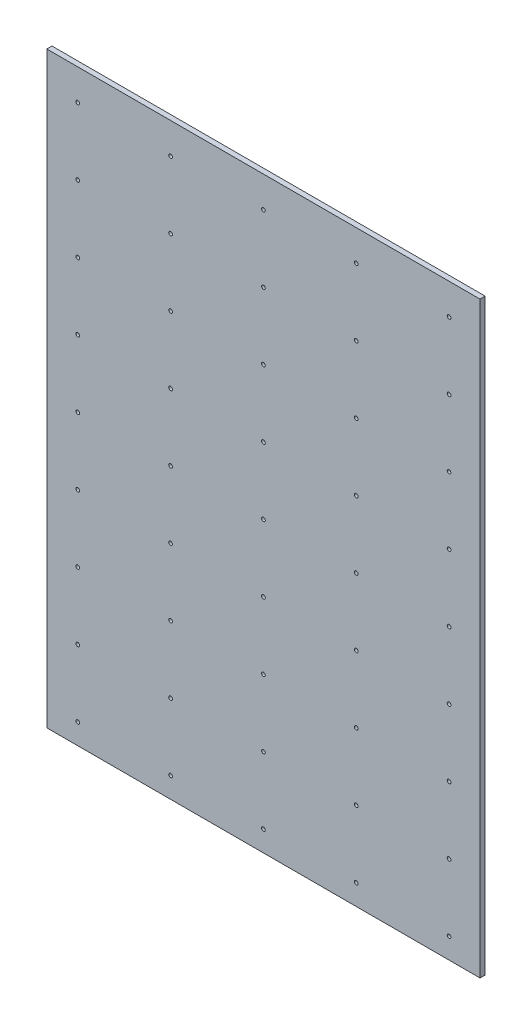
ISO-10303-21;
HEADER;
FILE_DESCRIPTION(('STEP AP214'),'2;1');
FILE_NAME('part.step','',(''),(''),'','','');
FILE_SCHEMA(('AUTOMOTIVE_DESIGN { 1 0 10303 214 1 1 1 1 }'));
ENDSEC;
DATA;
#1=APPLICATION_CONTEXT('core data for automotive mechanical design processes');
#2=APPLICATION_PROTOCOL_DEFINITION('international standard','automotive_design',2000,#1);
#3=PRODUCT_CONTEXT('',#1,'mechanical');
#4=PRODUCT('Part','Part','',(#3));
#5=PRODUCT_RELATED_PRODUCT_CATEGORY('part','',(#4));
#6=PRODUCT_DEFINITION_FORMATION('','',#4);
#7=PRODUCT_DEFINITION_CONTEXT('part definition',#1,'design');
#8=PRODUCT_DEFINITION('design','',#6,#7);
#9=PRODUCT_DEFINITION_SHAPE('','',#8);
#10=(LENGTH_UNIT() NAMED_UNIT(*) SI_UNIT(.MILLI.,.METRE.));
#11=(NAMED_UNIT(*) PLANE_ANGLE_UNIT() SI_UNIT($,.RADIAN.));
#12=(NAMED_UNIT(*) SI_UNIT($,.STERADIAN.) SOLID_ANGLE_UNIT());
#13=UNCERTAINTY_MEASURE_WITH_UNIT(LENGTH_MEASURE(1.E-05),#10,'distance_accuracy_value','');
#14=(GEOMETRIC_REPRESENTATION_CONTEXT(3) GLOBAL_UNCERTAINTY_ASSIGNED_CONTEXT((#13)) GLOBAL_UNIT_ASSIGNED_CONTEXT((#10,
#11,#12)) REPRESENTATION_CONTEXT('',''));
#15=CARTESIAN_POINT('',(0.,0.,0.));
#16=DIRECTION('',(0.,0.,1.));
#17=DIRECTION('',(1.,0.,0.));
#18=AXIS2_PLACEMENT_3D('',#15,#16,#17);
#19=CARTESIAN_POINT('',(0.,0.,10.));
#20=DIRECTION('',(0.,0.,-1.));
#21=DIRECTION('',(-1.,0.,0.));
#22=AXIS2_PLACEMENT_3D('',#19,#20,#21);
#23=PLANE('',#22);
#24=DIRECTION('',(0.,1.,0.));
#25=VECTOR('',#24,1.);
#26=CARTESIAN_POINT('',(420.,-570.,10.));
#27=LINE('',#26,#25);
#28=CARTESIAN_POINT('',(420.,-570.,10.));
#29=VERTEX_POINT('',#28);
#30=CARTESIAN_POINT('',(420.,570.,10.));
#31=VERTEX_POINT('',#30);
#32=EDGE_CURVE('E89',#29,#31,#27,.T.);
#33=ORIENTED_EDGE('',*,*,#32,.T.);
#34=DIRECTION('',(-1.,0.,0.));
#35=VECTOR('',#34,1.);
#36=CARTESIAN_POINT('',(-420.,570.,10.));
#37=LINE('',#36,#35);
#38=CARTESIAN_POINT('',(-420.,570.,10.));
#39=VERTEX_POINT('',#38);
#40=EDGE_CURVE('E84',#31,#39,#37,.T.);
#41=ORIENTED_EDGE('',*,*,#40,.T.);
#42=DIRECTION('',(0.,-1.,0.));
#43=VECTOR('',#42,1.);
#44=CARTESIAN_POINT('',(-420.,-570.,10.));
#45=LINE('',#44,#43);
#46=CARTESIAN_POINT('',(-420.,-570.,10.));
#47=VERTEX_POINT('',#46);
#48=EDGE_CURVE('E87',#39,#47,#45,.T.);
#49=ORIENTED_EDGE('',*,*,#48,.T.);
#50=DIRECTION('',(1.,0.,0.));
#51=VECTOR('',#50,1.);
#52=CARTESIAN_POINT('',(-420.,-570.,10.));
#53=LINE('',#52,#51);
#54=EDGE_CURVE('E54',#47,#29,#53,.T.);
#55=ORIENTED_EDGE('',*,*,#54,.T.);
#56=EDGE_LOOP('',(#33,#41,#49,#55));
#57=FACE_BOUND('',#56,.T.);
#58=CARTESIAN_POINT('',(-360.,510.,10.));
#59=DIRECTION('',(0.,0.,1.));
#60=DIRECTION('',(1.,0.,0.));
#61=AXIS2_PLACEMENT_3D('',#58,#59,#60);
#62=CIRCLE('',#61,3.60000000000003);
#63=CARTESIAN_POINT('',(-356.4,510.,10.));
#64=VERTEX_POINT('',#63);
#65=EDGE_CURVE('E104',#64,#64,#62,.T.);
#66=ORIENTED_EDGE('',*,*,#65,.F.);
#67=EDGE_LOOP('',(#66));
#68=FACE_BOUND('',#67,.T.);
#69=CARTESIAN_POINT('',(-360.,380.,10.));
#70=DIRECTION('',(0.,0.,1.));
#71=DIRECTION('',(1.,0.,0.));
#72=AXIS2_PLACEMENT_3D('',#69,#70,#71);
#73=CIRCLE('',#72,3.60000000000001);
#74=CARTESIAN_POINT('',(-356.4,380.,10.));
#75=VERTEX_POINT('',#74);
#76=EDGE_CURVE('E119',#75,#75,#73,.T.);
#77=ORIENTED_EDGE('',*,*,#76,.F.);
#78=EDGE_LOOP('',(#77));
#79=FACE_BOUND('',#78,.T.);
#80=CARTESIAN_POINT('',(-360.,250.,10.));
#81=DIRECTION('',(0.,0.,1.));
#82=DIRECTION('',(1.,0.,0.));
#83=AXIS2_PLACEMENT_3D('',#80,#81,#82);
#84=CIRCLE('',#83,3.60000000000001);
#85=CARTESIAN_POINT('',(-356.4,250.,10.));
#86=VERTEX_POINT('',#85);
#87=EDGE_CURVE('E125',#86,#86,#84,.T.);
#88=ORIENTED_EDGE('',*,*,#87,.F.);
#89=EDGE_LOOP('',(#88));
#90=FACE_BOUND('',#89,.T.);
#91=CARTESIAN_POINT('',(-360.,120.,10.));
#92=DIRECTION('',(0.,0.,1.));
#93=DIRECTION('',(1.,0.,0.));
#94=AXIS2_PLACEMENT_3D('',#91,#92,#93);
#95=CIRCLE('',#94,3.60000000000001);
#96=CARTESIAN_POINT('',(-356.4,120.,10.));
#97=VERTEX_POINT('',#96);
#98=EDGE_CURVE('E131',#97,#97,#95,.T.);
#99=ORIENTED_EDGE('',*,*,#98,.F.);
#100=EDGE_LOOP('',(#99));
#101=FACE_BOUND('',#100,.T.);
#102=CARTESIAN_POINT('',(-360.,-10.,10.));
#103=DIRECTION('',(0.,0.,1.));
#104=DIRECTION('',(1.,0.,0.));
#105=AXIS2_PLACEMENT_3D('',#102,#103,#104);
#106=CIRCLE('',#105,3.60000000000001);
#107=CARTESIAN_POINT('',(-356.4,-10.,10.));
#108=VERTEX_POINT('',#107);
#109=EDGE_CURVE('E137',#108,#108,#106,.T.);
#110=ORIENTED_EDGE('',*,*,#109,.F.);
#111=EDGE_LOOP('',(#110));
#112=FACE_BOUND('',#111,.T.);
#113=CARTESIAN_POINT('',(-360.,-140.,10.));
#114=DIRECTION('',(0.,0.,1.));
#115=DIRECTION('',(1.,0.,0.));
#116=AXIS2_PLACEMENT_3D('',#113,#114,#115);
#117=CIRCLE('',#116,3.60000000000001);
#118=CARTESIAN_POINT('',(-356.4,-140.,10.));
#119=VERTEX_POINT('',#118);
#120=EDGE_CURVE('E143',#119,#119,#117,.T.);
#121=ORIENTED_EDGE('',*,*,#120,.F.);
#122=EDGE_LOOP('',(#121));
#123=FACE_BOUND('',#122,.T.);
#124=CARTESIAN_POINT('',(-360.,-270.,10.));
#125=DIRECTION('',(0.,0.,1.));
#126=DIRECTION('',(1.,0.,0.));
#127=AXIS2_PLACEMENT_3D('',#124,#125,#126);
#128=CIRCLE('',#127,3.60000000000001);
#129=CARTESIAN_POINT('',(-356.4,-270.,10.));
#130=VERTEX_POINT('',#129);
#131=EDGE_CURVE('E149',#130,#130,#128,.T.);
#132=ORIENTED_EDGE('',*,*,#131,.F.);
#133=EDGE_LOOP('',(#132));
#134=FACE_BOUND('',#133,.T.);
#135=CARTESIAN_POINT('',(-360.,-400.,10.));
#136=DIRECTION('',(0.,0.,1.));
#137=DIRECTION('',(1.,0.,0.));
#138=AXIS2_PLACEMENT_3D('',#135,#136,#137);
#139=CIRCLE('',#138,3.60000000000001);
#140=CARTESIAN_POINT('',(-356.4,-400.,10.));
#141=VERTEX_POINT('',#140);
#142=EDGE_CURVE('E155',#141,#141,#139,.T.);
#143=ORIENTED_EDGE('',*,*,#142,.F.);
#144=EDGE_LOOP('',(#143));
#145=FACE_BOUND('',#144,.T.);
#146=CARTESIAN_POINT('',(-360.,-530.,10.));
#147=DIRECTION('',(0.,0.,1.));
#148=DIRECTION('',(1.,0.,0.));
#149=AXIS2_PLACEMENT_3D('',#146,#147,#148);
#150=CIRCLE('',#149,3.60000000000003);
#151=CARTESIAN_POINT('',(-356.4,-530.,10.));
#152=VERTEX_POINT('',#151);
#153=EDGE_CURVE('E161',#152,#152,#150,.T.);
#154=ORIENTED_EDGE('',*,*,#153,.F.);
#155=EDGE_LOOP('',(#154));
#156=FACE_BOUND('',#155,.T.);
#157=CARTESIAN_POINT('',(-180.,380.,10.));
#158=DIRECTION('',(0.,0.,1.));
#159=DIRECTION('',(1.,0.,0.));
#160=AXIS2_PLACEMENT_3D('',#157,#158,#159);
#161=CIRCLE('',#160,3.59999999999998);
#162=CARTESIAN_POINT('',(-176.4,380.,10.));
#163=VERTEX_POINT('',#162);
#164=EDGE_CURVE('E167',#163,#163,#161,.T.);
#165=ORIENTED_EDGE('',*,*,#164,.F.);
#166=EDGE_LOOP('',(#165));
#167=FACE_BOUND('',#166,.T.);
#168=CARTESIAN_POINT('',(-180.,250.,10.));
#169=DIRECTION('',(0.,0.,1.));
#170=DIRECTION('',(1.,0.,0.));
#171=AXIS2_PLACEMENT_3D('',#168,#169,#170);
#172=CIRCLE('',#171,3.59999999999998);
#173=CARTESIAN_POINT('',(-176.4,250.,10.));
#174=VERTEX_POINT('',#173);
#175=EDGE_CURVE('E173',#174,#174,#172,.T.);
#176=ORIENTED_EDGE('',*,*,#175,.F.);
#177=EDGE_LOOP('',(#176));
#178=FACE_BOUND('',#177,.T.);
#179=CARTESIAN_POINT('',(-180.,120.,10.));
#180=DIRECTION('',(0.,0.,1.));
#181=DIRECTION('',(1.,0.,0.));
#182=AXIS2_PLACEMENT_3D('',#179,#180,#181);
#183=CIRCLE('',#182,3.59999999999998);
#184=CARTESIAN_POINT('',(-176.4,120.,10.));
#185=VERTEX_POINT('',#184);
#186=EDGE_CURVE('E179',#185,#185,#183,.T.);
#187=ORIENTED_EDGE('',*,*,#186,.F.);
#188=EDGE_LOOP('',(#187));
#189=FACE_BOUND('',#188,.T.);
#190=CARTESIAN_POINT('',(-180.,-10.,10.));
#191=DIRECTION('',(0.,0.,1.));
#192=DIRECTION('',(1.,0.,0.));
#193=AXIS2_PLACEMENT_3D('',#190,#191,#192);
#194=CIRCLE('',#193,3.59999999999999);
#195=CARTESIAN_POINT('',(-176.4,-10.,10.));
#196=VERTEX_POINT('',#195);
#197=EDGE_CURVE('E185',#196,#196,#194,.T.);
#198=ORIENTED_EDGE('',*,*,#197,.F.);
#199=EDGE_LOOP('',(#198));
#200=FACE_BOUND('',#199,.T.);
#201=CARTESIAN_POINT('',(-180.,-140.,10.));
#202=DIRECTION('',(0.,0.,1.));
#203=DIRECTION('',(1.,0.,0.));
#204=AXIS2_PLACEMENT_3D('',#201,#202,#203);
#205=CIRCLE('',#204,3.59999999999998);
#206=CARTESIAN_POINT('',(-176.4,-140.,10.));
#207=VERTEX_POINT('',#206);
#208=EDGE_CURVE('E191',#207,#207,#205,.T.);
#209=ORIENTED_EDGE('',*,*,#208,.F.);
#210=EDGE_LOOP('',(#209));
#211=FACE_BOUND('',#210,.T.);
#212=CARTESIAN_POINT('',(-180.,-270.,10.));
#213=DIRECTION('',(0.,0.,1.));
#214=DIRECTION('',(1.,0.,0.));
#215=AXIS2_PLACEMENT_3D('',#212,#213,#214);
#216=CIRCLE('',#215,3.59999999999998);
#217=CARTESIAN_POINT('',(-176.4,-270.,10.));
#218=VERTEX_POINT('',#217);
#219=EDGE_CURVE('E197',#218,#218,#216,.T.);
#220=ORIENTED_EDGE('',*,*,#219,.F.);
#221=EDGE_LOOP('',(#220));
#222=FACE_BOUND('',#221,.T.);
#223=CARTESIAN_POINT('',(-180.,-400.,10.));
#224=DIRECTION('',(0.,0.,1.));
#225=DIRECTION('',(1.,0.,0.));
#226=AXIS2_PLACEMENT_3D('',#223,#224,#225);
#227=CIRCLE('',#226,3.59999999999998);
#228=CARTESIAN_POINT('',(-176.4,-400.,10.));
#229=VERTEX_POINT('',#228);
#230=EDGE_CURVE('E203',#229,#229,#227,.T.);
#231=ORIENTED_EDGE('',*,*,#230,.F.);
#232=EDGE_LOOP('',(#231));
#233=FACE_BOUND('',#232,.T.);
#234=CARTESIAN_POINT('',(-180.,-530.,10.));
#235=DIRECTION('',(0.,0.,1.));
#236=DIRECTION('',(1.,0.,0.));
#237=AXIS2_PLACEMENT_3D('',#234,#235,#236);
#238=CIRCLE('',#237,3.6);
#239=CARTESIAN_POINT('',(-176.4,-530.,10.));
#240=VERTEX_POINT('',#239);
#241=EDGE_CURVE('E209',#240,#240,#238,.T.);
#242=ORIENTED_EDGE('',*,*,#241,.F.);
#243=EDGE_LOOP('',(#242));
#244=FACE_BOUND('',#243,.T.);
#245=CARTESIAN_POINT('',(0.,380.,10.));
#246=DIRECTION('',(0.,0.,1.));
#247=DIRECTION('',(1.,0.,0.));
#248=AXIS2_PLACEMENT_3D('',#245,#246,#247);
#249=CIRCLE('',#248,3.6);
#250=CARTESIAN_POINT('',(3.60000000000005,380.,10.));
#251=VERTEX_POINT('',#250);
#252=EDGE_CURVE('E215',#251,#251,#249,.T.);
#253=ORIENTED_EDGE('',*,*,#252,.F.);
#254=EDGE_LOOP('',(#253));
#255=FACE_BOUND('',#254,.T.);
#256=CARTESIAN_POINT('',(0.,250.,10.));
#257=DIRECTION('',(0.,0.,1.));
#258=DIRECTION('',(1.,0.,0.));
#259=AXIS2_PLACEMENT_3D('',#256,#257,#258);
#260=CIRCLE('',#259,3.6);
#261=CARTESIAN_POINT('',(3.60000000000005,250.,10.));
#262=VERTEX_POINT('',#261);
#263=EDGE_CURVE('E221',#262,#262,#260,.T.);
#264=ORIENTED_EDGE('',*,*,#263,.F.);
#265=EDGE_LOOP('',(#264));
#266=FACE_BOUND('',#265,.T.);
#267=CARTESIAN_POINT('',(0.,120.,10.));
#268=DIRECTION('',(0.,0.,1.));
#269=DIRECTION('',(1.,0.,0.));
#270=AXIS2_PLACEMENT_3D('',#267,#268,#269);
#271=CIRCLE('',#270,3.6);
#272=CARTESIAN_POINT('',(3.60000000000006,120.,10.));
#273=VERTEX_POINT('',#272);
#274=EDGE_CURVE('E227',#273,#273,#271,.T.);
#275=ORIENTED_EDGE('',*,*,#274,.F.);
#276=EDGE_LOOP('',(#275));
#277=FACE_BOUND('',#276,.T.);
#278=CARTESIAN_POINT('',(0.,-10.,10.));
#279=DIRECTION('',(0.,0.,1.));
#280=DIRECTION('',(1.,0.,0.));
#281=AXIS2_PLACEMENT_3D('',#278,#279,#280);
#282=CIRCLE('',#281,3.6);
#283=CARTESIAN_POINT('',(3.60000000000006,-10.,10.));
#284=VERTEX_POINT('',#283);
#285=EDGE_CURVE('E233',#284,#284,#282,.T.);
#286=ORIENTED_EDGE('',*,*,#285,.F.);
#287=EDGE_LOOP('',(#286));
#288=FACE_BOUND('',#287,.T.);
#289=CARTESIAN_POINT('',(0.,-140.,10.));
#290=DIRECTION('',(0.,0.,1.));
#291=DIRECTION('',(1.,0.,0.));
#292=AXIS2_PLACEMENT_3D('',#289,#290,#291);
#293=CIRCLE('',#292,3.6);
#294=CARTESIAN_POINT('',(3.60000000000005,-140.,10.));
#295=VERTEX_POINT('',#294);
#296=EDGE_CURVE('E239',#295,#295,#293,.T.);
#297=ORIENTED_EDGE('',*,*,#296,.F.);
#298=EDGE_LOOP('',(#297));
#299=FACE_BOUND('',#298,.T.);
#300=CARTESIAN_POINT('',(0.,-270.,10.));
#301=DIRECTION('',(0.,0.,1.));
#302=DIRECTION('',(1.,0.,0.));
#303=AXIS2_PLACEMENT_3D('',#300,#301,#302);
#304=CIRCLE('',#303,3.6);
#305=CARTESIAN_POINT('',(3.60000000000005,-270.,10.));
#306=VERTEX_POINT('',#305);
#307=EDGE_CURVE('E245',#306,#306,#304,.T.);
#308=ORIENTED_EDGE('',*,*,#307,.F.);
#309=EDGE_LOOP('',(#308));
#310=FACE_BOUND('',#309,.T.);
#311=CARTESIAN_POINT('',(0.,-400.,10.));
#312=DIRECTION('',(0.,0.,1.));
#313=DIRECTION('',(1.,0.,0.));
#314=AXIS2_PLACEMENT_3D('',#311,#312,#313);
#315=CIRCLE('',#314,3.6);
#316=CARTESIAN_POINT('',(3.60000000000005,-400.,10.));
#317=VERTEX_POINT('',#316);
#318=EDGE_CURVE('E251',#317,#317,#315,.T.);
#319=ORIENTED_EDGE('',*,*,#318,.F.);
#320=EDGE_LOOP('',(#319));
#321=FACE_BOUND('',#320,.T.);
#322=CARTESIAN_POINT('',(0.,-530.,10.));
#323=DIRECTION('',(0.,0.,1.));
#324=DIRECTION('',(1.,0.,0.));
#325=AXIS2_PLACEMENT_3D('',#322,#323,#324);
#326=CIRCLE('',#325,3.60000000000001);
#327=CARTESIAN_POINT('',(3.60000000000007,-530.,10.));
#328=VERTEX_POINT('',#327);
#329=EDGE_CURVE('E257',#328,#328,#326,.T.);
#330=ORIENTED_EDGE('',*,*,#329,.F.);
#331=EDGE_LOOP('',(#330));
#332=FACE_BOUND('',#331,.T.);
#333=CARTESIAN_POINT('',(180.,380.,10.));
#334=DIRECTION('',(0.,0.,1.));
#335=DIRECTION('',(1.,0.,0.));
#336=AXIS2_PLACEMENT_3D('',#333,#334,#335);
#337=CIRCLE('',#336,3.59999999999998);
#338=CARTESIAN_POINT('',(183.6,380.,10.));
#339=VERTEX_POINT('',#338);
#340=EDGE_CURVE('E263',#339,#339,#337,.T.);
#341=ORIENTED_EDGE('',*,*,#340,.F.);
#342=EDGE_LOOP('',(#341));
#343=FACE_BOUND('',#342,.T.);
#344=CARTESIAN_POINT('',(180.,250.,10.));
#345=DIRECTION('',(0.,0.,1.));
#346=DIRECTION('',(1.,0.,0.));
#347=AXIS2_PLACEMENT_3D('',#344,#345,#346);
#348=CIRCLE('',#347,3.59999999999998);
#349=CARTESIAN_POINT('',(183.6,250.,10.));
#350=VERTEX_POINT('',#349);
#351=EDGE_CURVE('E269',#350,#350,#348,.T.);
#352=ORIENTED_EDGE('',*,*,#351,.F.);
#353=EDGE_LOOP('',(#352));
#354=FACE_BOUND('',#353,.T.);
#355=CARTESIAN_POINT('',(180.,120.,10.));
#356=DIRECTION('',(0.,0.,1.));
#357=DIRECTION('',(1.,0.,0.));
#358=AXIS2_PLACEMENT_3D('',#355,#356,#357);
#359=CIRCLE('',#358,3.59999999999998);
#360=CARTESIAN_POINT('',(183.6,120.,10.));
#361=VERTEX_POINT('',#360);
#362=EDGE_CURVE('E275',#361,#361,#359,.T.);
#363=ORIENTED_EDGE('',*,*,#362,.F.);
#364=EDGE_LOOP('',(#363));
#365=FACE_BOUND('',#364,.T.);
#366=CARTESIAN_POINT('',(180.,-10.,10.));
#367=DIRECTION('',(0.,0.,1.));
#368=DIRECTION('',(1.,0.,0.));
#369=AXIS2_PLACEMENT_3D('',#366,#367,#368);
#370=CIRCLE('',#369,3.59999999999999);
#371=CARTESIAN_POINT('',(183.6,-10.,10.));
#372=VERTEX_POINT('',#371);
#373=EDGE_CURVE('E281',#372,#372,#370,.T.);
#374=ORIENTED_EDGE('',*,*,#373,.F.);
#375=EDGE_LOOP('',(#374));
#376=FACE_BOUND('',#375,.T.);
#377=CARTESIAN_POINT('',(180.,-140.,10.));
#378=DIRECTION('',(0.,0.,1.));
#379=DIRECTION('',(1.,0.,0.));
#380=AXIS2_PLACEMENT_3D('',#377,#378,#379);
#381=CIRCLE('',#380,3.59999999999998);
#382=CARTESIAN_POINT('',(183.6,-140.,10.));
#383=VERTEX_POINT('',#382);
#384=EDGE_CURVE('E287',#383,#383,#381,.T.);
#385=ORIENTED_EDGE('',*,*,#384,.F.);
#386=EDGE_LOOP('',(#385));
#387=FACE_BOUND('',#386,.T.);
#388=CARTESIAN_POINT('',(180.,-270.,10.));
#389=DIRECTION('',(0.,0.,1.));
#390=DIRECTION('',(1.,0.,0.));
#391=AXIS2_PLACEMENT_3D('',#388,#389,#390);
#392=CIRCLE('',#391,3.59999999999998);
#393=CARTESIAN_POINT('',(183.6,-270.,10.));
#394=VERTEX_POINT('',#393);
#395=EDGE_CURVE('E293',#394,#394,#392,.T.);
#396=ORIENTED_EDGE('',*,*,#395,.F.);
#397=EDGE_LOOP('',(#396));
#398=FACE_BOUND('',#397,.T.);
#399=CARTESIAN_POINT('',(180.,-400.,10.));
#400=DIRECTION('',(0.,0.,1.));
#401=DIRECTION('',(1.,0.,0.));
#402=AXIS2_PLACEMENT_3D('',#399,#400,#401);
#403=CIRCLE('',#402,3.59999999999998);
#404=CARTESIAN_POINT('',(183.6,-400.,10.));
#405=VERTEX_POINT('',#404);
#406=EDGE_CURVE('E299',#405,#405,#403,.T.);
#407=ORIENTED_EDGE('',*,*,#406,.F.);
#408=EDGE_LOOP('',(#407));
#409=FACE_BOUND('',#408,.T.);
#410=CARTESIAN_POINT('',(180.,-530.,10.));
#411=DIRECTION('',(0.,0.,1.));
#412=DIRECTION('',(1.,0.,0.));
#413=AXIS2_PLACEMENT_3D('',#410,#411,#412);
#414=CIRCLE('',#413,3.6);
#415=CARTESIAN_POINT('',(183.6,-530.,10.));
#416=VERTEX_POINT('',#415);
#417=EDGE_CURVE('E305',#416,#416,#414,.T.);
#418=ORIENTED_EDGE('',*,*,#417,.F.);
#419=EDGE_LOOP('',(#418));
#420=FACE_BOUND('',#419,.T.);
#421=CARTESIAN_POINT('',(360.,380.,10.));
#422=DIRECTION('',(0.,0.,1.));
#423=DIRECTION('',(1.,0.,0.));
#424=AXIS2_PLACEMENT_3D('',#421,#422,#423);
#425=CIRCLE('',#424,3.60000000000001);
#426=CARTESIAN_POINT('',(363.6,380.,10.));
#427=VERTEX_POINT('',#426);
#428=EDGE_CURVE('E311',#427,#427,#425,.T.);
#429=ORIENTED_EDGE('',*,*,#428,.F.);
#430=EDGE_LOOP('',(#429));
#431=FACE_BOUND('',#430,.T.);
#432=CARTESIAN_POINT('',(360.,250.,10.));
#433=DIRECTION('',(0.,0.,1.));
#434=DIRECTION('',(1.,0.,0.));
#435=AXIS2_PLACEMENT_3D('',#432,#433,#434);
#436=CIRCLE('',#435,3.60000000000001);
#437=CARTESIAN_POINT('',(363.6,250.,10.));
#438=VERTEX_POINT('',#437);
#439=EDGE_CURVE('E317',#438,#438,#436,.T.);
#440=ORIENTED_EDGE('',*,*,#439,.F.);
#441=EDGE_LOOP('',(#440));
#442=FACE_BOUND('',#441,.T.);
#443=CARTESIAN_POINT('',(360.,120.,10.));
#444=DIRECTION('',(0.,0.,1.));
#445=DIRECTION('',(1.,0.,0.));
#446=AXIS2_PLACEMENT_3D('',#443,#444,#445);
#447=CIRCLE('',#446,3.60000000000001);
#448=CARTESIAN_POINT('',(363.6,120.,10.));
#449=VERTEX_POINT('',#448);
#450=EDGE_CURVE('E323',#449,#449,#447,.T.);
#451=ORIENTED_EDGE('',*,*,#450,.F.);
#452=EDGE_LOOP('',(#451));
#453=FACE_BOUND('',#452,.T.);
#454=CARTESIAN_POINT('',(360.,-10.,10.));
#455=DIRECTION('',(0.,0.,1.));
#456=DIRECTION('',(1.,0.,0.));
#457=AXIS2_PLACEMENT_3D('',#454,#455,#456);
#458=CIRCLE('',#457,3.60000000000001);
#459=CARTESIAN_POINT('',(363.6,-10.,10.));
#460=VERTEX_POINT('',#459);
#461=EDGE_CURVE('E329',#460,#460,#458,.T.);
#462=ORIENTED_EDGE('',*,*,#461,.F.);
#463=EDGE_LOOP('',(#462));
#464=FACE_BOUND('',#463,.T.);
#465=CARTESIAN_POINT('',(360.,-140.,10.));
#466=DIRECTION('',(0.,0.,1.));
#467=DIRECTION('',(1.,0.,0.));
#468=AXIS2_PLACEMENT_3D('',#465,#466,#467);
#469=CIRCLE('',#468,3.60000000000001);
#470=CARTESIAN_POINT('',(363.6,-140.,10.));
#471=VERTEX_POINT('',#470);
#472=EDGE_CURVE('E335',#471,#471,#469,.T.);
#473=ORIENTED_EDGE('',*,*,#472,.F.);
#474=EDGE_LOOP('',(#473));
#475=FACE_BOUND('',#474,.T.);
#476=CARTESIAN_POINT('',(360.,-270.,10.));
#477=DIRECTION('',(0.,0.,1.));
#478=DIRECTION('',(1.,0.,0.));
#479=AXIS2_PLACEMENT_3D('',#476,#477,#478);
#480=CIRCLE('',#479,3.60000000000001);
#481=CARTESIAN_POINT('',(363.6,-270.,10.));
#482=VERTEX_POINT('',#481);
#483=EDGE_CURVE('E341',#482,#482,#480,.T.);
#484=ORIENTED_EDGE('',*,*,#483,.F.);
#485=EDGE_LOOP('',(#484));
#486=FACE_BOUND('',#485,.T.);
#487=CARTESIAN_POINT('',(360.,-400.,10.));
#488=DIRECTION('',(0.,0.,1.));
#489=DIRECTION('',(1.,0.,0.));
#490=AXIS2_PLACEMENT_3D('',#487,#488,#489);
#491=CIRCLE('',#490,3.60000000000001);
#492=CARTESIAN_POINT('',(363.6,-400.,10.));
#493=VERTEX_POINT('',#492);
#494=EDGE_CURVE('E347',#493,#493,#491,.T.);
#495=ORIENTED_EDGE('',*,*,#494,.F.);
#496=EDGE_LOOP('',(#495));
#497=FACE_BOUND('',#496,.T.);
#498=CARTESIAN_POINT('',(360.,-530.,10.));
#499=DIRECTION('',(0.,0.,1.));
#500=DIRECTION('',(1.,0.,0.));
#501=AXIS2_PLACEMENT_3D('',#498,#499,#500);
#502=CIRCLE('',#501,3.60000000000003);
#503=CARTESIAN_POINT('',(363.6,-530.,10.));
#504=VERTEX_POINT('',#503);
#505=EDGE_CURVE('E353',#504,#504,#502,.T.);
#506=ORIENTED_EDGE('',*,*,#505,.F.);
#507=EDGE_LOOP('',(#506));
#508=FACE_BOUND('',#507,.T.);
#509=CARTESIAN_POINT('',(-180.,510.,10.));
#510=DIRECTION('',(0.,0.,1.));
#511=DIRECTION('',(1.,0.,0.));
#512=AXIS2_PLACEMENT_3D('',#509,#510,#511);
#513=CIRCLE('',#512,3.6);
#514=CARTESIAN_POINT('',(-176.4,510.,10.));
#515=VERTEX_POINT('',#514);
#516=EDGE_CURVE('E359',#515,#515,#513,.T.);
#517=ORIENTED_EDGE('',*,*,#516,.F.);
#518=EDGE_LOOP('',(#517));
#519=FACE_BOUND('',#518,.T.);
#520=CARTESIAN_POINT('',(0.,510.,10.));
#521=DIRECTION('',(0.,0.,1.));
#522=DIRECTION('',(1.,0.,0.));
#523=AXIS2_PLACEMENT_3D('',#520,#521,#522);
#524=CIRCLE('',#523,3.60000000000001);
#525=CARTESIAN_POINT('',(3.60000000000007,510.,10.));
#526=VERTEX_POINT('',#525);
#527=EDGE_CURVE('E365',#526,#526,#524,.T.);
#528=ORIENTED_EDGE('',*,*,#527,.F.);
#529=EDGE_LOOP('',(#528));
#530=FACE_BOUND('',#529,.T.);
#531=CARTESIAN_POINT('',(180.,510.,10.));
#532=DIRECTION('',(0.,0.,1.));
#533=DIRECTION('',(1.,0.,0.));
#534=AXIS2_PLACEMENT_3D('',#531,#532,#533);
#535=CIRCLE('',#534,3.6);
#536=CARTESIAN_POINT('',(183.6,510.,10.));
#537=VERTEX_POINT('',#536);
#538=EDGE_CURVE('E371',#537,#537,#535,.T.);
#539=ORIENTED_EDGE('',*,*,#538,.F.);
#540=EDGE_LOOP('',(#539));
#541=FACE_BOUND('',#540,.T.);
#542=CARTESIAN_POINT('',(360.,510.,10.));
#543=DIRECTION('',(0.,0.,1.));
#544=DIRECTION('',(1.,0.,0.));
#545=AXIS2_PLACEMENT_3D('',#542,#543,#544);
#546=CIRCLE('',#545,3.60000000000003);
#547=CARTESIAN_POINT('',(363.6,510.,10.));
#548=VERTEX_POINT('',#547);
#549=EDGE_CURVE('E377',#548,#548,#546,.T.);
#550=ORIENTED_EDGE('',*,*,#549,.F.);
#551=EDGE_LOOP('',(#550));
#552=FACE_BOUND('',#551,.T.);
#553=ADVANCED_FACE('F37',(#57,#68,#79,#90,#101,#112,#123,#134,#145,#156,#167,#178,#189,#200,
#211,#222,#233,#244,#255,#266,#277,#288,#299,#310,#321,#332,#343,#354,#365,#376,#387,#398,#409,
#420,#431,#442,#453,#464,#475,#486,#497,#508,#519,#530,#541,#552),#23,.F.);
#554=CARTESIAN_POINT('',(0.,0.,0.));
#555=DIRECTION('',(0.,0.,-1.));
#556=DIRECTION('',(-1.,0.,0.));
#557=AXIS2_PLACEMENT_3D('',#554,#555,#556);
#558=PLANE('',#557);
#559=CARTESIAN_POINT('',(180.,510.,0.));
#560=DIRECTION('',(0.,0.,1.));
#561=DIRECTION('',(1.,0.,0.));
#562=AXIS2_PLACEMENT_3D('',#559,#560,#561);
#563=CIRCLE('',#562,3.6);
#564=CARTESIAN_POINT('',(183.6,510.,0.));
#565=VERTEX_POINT('',#564);
#566=EDGE_CURVE('E374',#565,#565,#563,.T.);
#567=ORIENTED_EDGE('',*,*,#566,.T.);
#568=EDGE_LOOP('',(#567));
#569=FACE_BOUND('',#568,.T.);
#570=CARTESIAN_POINT('',(-180.,510.,0.));
#571=DIRECTION('',(0.,0.,1.));
#572=DIRECTION('',(1.,0.,0.));
#573=AXIS2_PLACEMENT_3D('',#570,#571,#572);
#574=CIRCLE('',#573,3.6);
#575=CARTESIAN_POINT('',(-176.4,510.,0.));
#576=VERTEX_POINT('',#575);
#577=EDGE_CURVE('E362',#576,#576,#574,.T.);
#578=ORIENTED_EDGE('',*,*,#577,.T.);
#579=EDGE_LOOP('',(#578));
#580=FACE_BOUND('',#579,.T.);
#581=CARTESIAN_POINT('',(360.,-400.,0.));
#582=DIRECTION('',(0.,0.,1.));
#583=DIRECTION('',(1.,0.,0.));
#584=AXIS2_PLACEMENT_3D('',#581,#582,#583);
#585=CIRCLE('',#584,3.60000000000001);
#586=CARTESIAN_POINT('',(363.6,-400.,0.));
#587=VERTEX_POINT('',#586);
#588=EDGE_CURVE('E350',#587,#587,#585,.T.);
#589=ORIENTED_EDGE('',*,*,#588,.T.);
#590=EDGE_LOOP('',(#589));
#591=FACE_BOUND('',#590,.T.);
#592=CARTESIAN_POINT('',(360.,-140.,0.));
#593=DIRECTION('',(0.,0.,1.));
#594=DIRECTION('',(1.,0.,0.));
#595=AXIS2_PLACEMENT_3D('',#592,#593,#594);
#596=CIRCLE('',#595,3.60000000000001);
#597=CARTESIAN_POINT('',(363.6,-140.,0.));
#598=VERTEX_POINT('',#597);
#599=EDGE_CURVE('E338',#598,#598,#596,.T.);
#600=ORIENTED_EDGE('',*,*,#599,.T.);
#601=EDGE_LOOP('',(#600));
#602=FACE_BOUND('',#601,.T.);
#603=CARTESIAN_POINT('',(360.,120.,0.));
#604=DIRECTION('',(0.,0.,1.));
#605=DIRECTION('',(1.,0.,0.));
#606=AXIS2_PLACEMENT_3D('',#603,#604,#605);
#607=CIRCLE('',#606,3.60000000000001);
#608=CARTESIAN_POINT('',(363.6,120.,0.));
#609=VERTEX_POINT('',#608);
#610=EDGE_CURVE('E326',#609,#609,#607,.T.);
#611=ORIENTED_EDGE('',*,*,#610,.T.);
#612=EDGE_LOOP('',(#611));
#613=FACE_BOUND('',#612,.T.);
#614=CARTESIAN_POINT('',(360.,380.,0.));
#615=DIRECTION('',(0.,0.,1.));
#616=DIRECTION('',(1.,0.,0.));
#617=AXIS2_PLACEMENT_3D('',#614,#615,#616);
#618=CIRCLE('',#617,3.60000000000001);
#619=CARTESIAN_POINT('',(363.6,380.,0.));
#620=VERTEX_POINT('',#619);
#621=EDGE_CURVE('E314',#620,#620,#618,.T.);
#622=ORIENTED_EDGE('',*,*,#621,.T.);
#623=EDGE_LOOP('',(#622));
#624=FACE_BOUND('',#623,.T.);
#625=CARTESIAN_POINT('',(180.,-400.,0.));
#626=DIRECTION('',(0.,0.,1.));
#627=DIRECTION('',(1.,0.,0.));
#628=AXIS2_PLACEMENT_3D('',#625,#626,#627);
#629=CIRCLE('',#628,3.59999999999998);
#630=CARTESIAN_POINT('',(183.6,-400.,0.));
#631=VERTEX_POINT('',#630);
#632=EDGE_CURVE('E302',#631,#631,#629,.T.);
#633=ORIENTED_EDGE('',*,*,#632,.T.);
#634=EDGE_LOOP('',(#633));
#635=FACE_BOUND('',#634,.T.);
#636=CARTESIAN_POINT('',(180.,-140.,0.));
#637=DIRECTION('',(0.,0.,1.));
#638=DIRECTION('',(1.,0.,0.));
#639=AXIS2_PLACEMENT_3D('',#636,#637,#638);
#640=CIRCLE('',#639,3.59999999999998);
#641=CARTESIAN_POINT('',(183.6,-140.,0.));
#642=VERTEX_POINT('',#641);
#643=EDGE_CURVE('E290',#642,#642,#640,.T.);
#644=ORIENTED_EDGE('',*,*,#643,.T.);
#645=EDGE_LOOP('',(#644));
#646=FACE_BOUND('',#645,.T.);
#647=CARTESIAN_POINT('',(180.,120.,0.));
#648=DIRECTION('',(0.,0.,1.));
#649=DIRECTION('',(1.,0.,0.));
#650=AXIS2_PLACEMENT_3D('',#647,#648,#649);
#651=CIRCLE('',#650,3.59999999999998);
#652=CARTESIAN_POINT('',(183.6,120.,0.));
#653=VERTEX_POINT('',#652);
#654=EDGE_CURVE('E278',#653,#653,#651,.T.);
#655=ORIENTED_EDGE('',*,*,#654,.T.);
#656=EDGE_LOOP('',(#655));
#657=FACE_BOUND('',#656,.T.);
#658=CARTESIAN_POINT('',(180.,380.,0.));
#659=DIRECTION('',(0.,0.,1.));
#660=DIRECTION('',(1.,0.,0.));
#661=AXIS2_PLACEMENT_3D('',#658,#659,#660);
#662=CIRCLE('',#661,3.59999999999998);
#663=CARTESIAN_POINT('',(183.6,380.,0.));
#664=VERTEX_POINT('',#663);
#665=EDGE_CURVE('E266',#664,#664,#662,.T.);
#666=ORIENTED_EDGE('',*,*,#665,.T.);
#667=EDGE_LOOP('',(#666));
#668=FACE_BOUND('',#667,.T.);
#669=CARTESIAN_POINT('',(0.,-400.,0.));
#670=DIRECTION('',(0.,0.,1.));
#671=DIRECTION('',(1.,0.,0.));
#672=AXIS2_PLACEMENT_3D('',#669,#670,#671);
#673=CIRCLE('',#672,3.6);
#674=CARTESIAN_POINT('',(3.60000000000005,-400.,0.));
#675=VERTEX_POINT('',#674);
#676=EDGE_CURVE('E254',#675,#675,#673,.T.);
#677=ORIENTED_EDGE('',*,*,#676,.T.);
#678=EDGE_LOOP('',(#677));
#679=FACE_BOUND('',#678,.T.);
#680=CARTESIAN_POINT('',(0.,-140.,0.));
#681=DIRECTION('',(0.,0.,1.));
#682=DIRECTION('',(1.,0.,0.));
#683=AXIS2_PLACEMENT_3D('',#680,#681,#682);
#684=CIRCLE('',#683,3.6);
#685=CARTESIAN_POINT('',(3.60000000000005,-140.,0.));
#686=VERTEX_POINT('',#685);
#687=EDGE_CURVE('E242',#686,#686,#684,.T.);
#688=ORIENTED_EDGE('',*,*,#687,.T.);
#689=EDGE_LOOP('',(#688));
#690=FACE_BOUND('',#689,.T.);
#691=CARTESIAN_POINT('',(0.,120.,0.));
#692=DIRECTION('',(0.,0.,1.));
#693=DIRECTION('',(1.,0.,0.));
#694=AXIS2_PLACEMENT_3D('',#691,#692,#693);
#695=CIRCLE('',#694,3.6);
#696=CARTESIAN_POINT('',(3.60000000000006,120.,0.));
#697=VERTEX_POINT('',#696);
#698=EDGE_CURVE('E230',#697,#697,#695,.T.);
#699=ORIENTED_EDGE('',*,*,#698,.T.);
#700=EDGE_LOOP('',(#699));
#701=FACE_BOUND('',#700,.T.);
#702=CARTESIAN_POINT('',(0.,380.,0.));
#703=DIRECTION('',(0.,0.,1.));
#704=DIRECTION('',(1.,0.,0.));
#705=AXIS2_PLACEMENT_3D('',#702,#703,#704);
#706=CIRCLE('',#705,3.6);
#707=CARTESIAN_POINT('',(3.60000000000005,380.,0.));
#708=VERTEX_POINT('',#707);
#709=EDGE_CURVE('E218',#708,#708,#706,.T.);
#710=ORIENTED_EDGE('',*,*,#709,.T.);
#711=EDGE_LOOP('',(#710));
#712=FACE_BOUND('',#711,.T.);
#713=CARTESIAN_POINT('',(-180.,-400.,0.));
#714=DIRECTION('',(0.,0.,1.));
#715=DIRECTION('',(1.,0.,0.));
#716=AXIS2_PLACEMENT_3D('',#713,#714,#715);
#717=CIRCLE('',#716,3.59999999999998);
#718=CARTESIAN_POINT('',(-176.4,-400.,0.));
#719=VERTEX_POINT('',#718);
#720=EDGE_CURVE('E206',#719,#719,#717,.T.);
#721=ORIENTED_EDGE('',*,*,#720,.T.);
#722=EDGE_LOOP('',(#721));
#723=FACE_BOUND('',#722,.T.);
#724=CARTESIAN_POINT('',(-180.,-140.,0.));
#725=DIRECTION('',(0.,0.,1.));
#726=DIRECTION('',(1.,0.,0.));
#727=AXIS2_PLACEMENT_3D('',#724,#725,#726);
#728=CIRCLE('',#727,3.59999999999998);
#729=CARTESIAN_POINT('',(-176.4,-140.,0.));
#730=VERTEX_POINT('',#729);
#731=EDGE_CURVE('E194',#730,#730,#728,.T.);
#732=ORIENTED_EDGE('',*,*,#731,.T.);
#733=EDGE_LOOP('',(#732));
#734=FACE_BOUND('',#733,.T.);
#735=CARTESIAN_POINT('',(-180.,120.,0.));
#736=DIRECTION('',(0.,0.,1.));
#737=DIRECTION('',(1.,0.,0.));
#738=AXIS2_PLACEMENT_3D('',#735,#736,#737);
#739=CIRCLE('',#738,3.59999999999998);
#740=CARTESIAN_POINT('',(-176.4,120.,0.));
#741=VERTEX_POINT('',#740);
#742=EDGE_CURVE('E182',#741,#741,#739,.T.);
#743=ORIENTED_EDGE('',*,*,#742,.T.);
#744=EDGE_LOOP('',(#743));
#745=FACE_BOUND('',#744,.T.);
#746=CARTESIAN_POINT('',(-180.,380.,0.));
#747=DIRECTION('',(0.,0.,1.));
#748=DIRECTION('',(1.,0.,0.));
#749=AXIS2_PLACEMENT_3D('',#746,#747,#748);
#750=CIRCLE('',#749,3.59999999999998);
#751=CARTESIAN_POINT('',(-176.4,380.,0.));
#752=VERTEX_POINT('',#751);
#753=EDGE_CURVE('E170',#752,#752,#750,.T.);
#754=ORIENTED_EDGE('',*,*,#753,.T.);
#755=EDGE_LOOP('',(#754));
#756=FACE_BOUND('',#755,.T.);
#757=CARTESIAN_POINT('',(-360.,-400.,0.));
#758=DIRECTION('',(0.,0.,1.));
#759=DIRECTION('',(1.,0.,0.));
#760=AXIS2_PLACEMENT_3D('',#757,#758,#759);
#761=CIRCLE('',#760,3.60000000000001);
#762=CARTESIAN_POINT('',(-356.4,-400.,0.));
#763=VERTEX_POINT('',#762);
#764=EDGE_CURVE('E158',#763,#763,#761,.T.);
#765=ORIENTED_EDGE('',*,*,#764,.T.);
#766=EDGE_LOOP('',(#765));
#767=FACE_BOUND('',#766,.T.);
#768=CARTESIAN_POINT('',(-360.,-140.,0.));
#769=DIRECTION('',(0.,0.,1.));
#770=DIRECTION('',(1.,0.,0.));
#771=AXIS2_PLACEMENT_3D('',#768,#769,#770);
#772=CIRCLE('',#771,3.60000000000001);
#773=CARTESIAN_POINT('',(-356.4,-140.,0.));
#774=VERTEX_POINT('',#773);
#775=EDGE_CURVE('E146',#774,#774,#772,.T.);
#776=ORIENTED_EDGE('',*,*,#775,.T.);
#777=EDGE_LOOP('',(#776));
#778=FACE_BOUND('',#777,.T.);
#779=CARTESIAN_POINT('',(-360.,120.,0.));
#780=DIRECTION('',(0.,0.,1.));
#781=DIRECTION('',(1.,0.,0.));
#782=AXIS2_PLACEMENT_3D('',#779,#780,#781);
#783=CIRCLE('',#782,3.60000000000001);
#784=CARTESIAN_POINT('',(-356.4,120.,0.));
#785=VERTEX_POINT('',#784);
#786=EDGE_CURVE('E134',#785,#785,#783,.T.);
#787=ORIENTED_EDGE('',*,*,#786,.T.);
#788=EDGE_LOOP('',(#787));
#789=FACE_BOUND('',#788,.T.);
#790=CARTESIAN_POINT('',(-360.,380.,0.));
#791=DIRECTION('',(0.,0.,1.));
#792=DIRECTION('',(1.,0.,0.));
#793=AXIS2_PLACEMENT_3D('',#790,#791,#792);
#794=CIRCLE('',#793,3.60000000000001);
#795=CARTESIAN_POINT('',(-356.4,380.,0.));
#796=VERTEX_POINT('',#795);
#797=EDGE_CURVE('E122',#796,#796,#794,.T.);
#798=ORIENTED_EDGE('',*,*,#797,.T.);
#799=EDGE_LOOP('',(#798));
#800=FACE_BOUND('',#799,.T.);
#801=DIRECTION('',(0.,1.,0.));
#802=VECTOR('',#801,1.);
#803=CARTESIAN_POINT('',(420.,-570.,0.));
#804=LINE('',#803,#802);
#805=CARTESIAN_POINT('',(420.,-570.,0.));
#806=VERTEX_POINT('',#805);
#807=CARTESIAN_POINT('',(420.,570.,0.));
#808=VERTEX_POINT('',#807);
#809=EDGE_CURVE('E101',#806,#808,#804,.T.);
#810=ORIENTED_EDGE('',*,*,#809,.F.);
#811=DIRECTION('',(1.,0.,0.));
#812=VECTOR('',#811,1.);
#813=CARTESIAN_POINT('',(-420.,-570.,0.));
#814=LINE('',#813,#812);
#815=CARTESIAN_POINT('',(-420.,-570.,0.));
#816=VERTEX_POINT('',#815);
#817=EDGE_CURVE('E77',#816,#806,#814,.T.);
#818=ORIENTED_EDGE('',*,*,#817,.F.);
#819=DIRECTION('',(0.,-1.,0.));
#820=VECTOR('',#819,1.);
#821=CARTESIAN_POINT('',(-420.,-570.,0.));
#822=LINE('',#821,#820);
#823=CARTESIAN_POINT('',(-420.,570.,0.));
#824=VERTEX_POINT('',#823);
#825=EDGE_CURVE('E71',#824,#816,#822,.T.);
#826=ORIENTED_EDGE('',*,*,#825,.F.);
#827=DIRECTION('',(-1.,0.,0.));
#828=VECTOR('',#827,1.);
#829=CARTESIAN_POINT('',(-420.,570.,0.));
#830=LINE('',#829,#828);
#831=EDGE_CURVE('E93',#808,#824,#830,.T.);
#832=ORIENTED_EDGE('',*,*,#831,.F.);
#833=EDGE_LOOP('',(#810,#818,#826,#832));
#834=FACE_BOUND('',#833,.T.);
#835=CARTESIAN_POINT('',(-360.,510.,0.));
#836=DIRECTION('',(0.,0.,1.));
#837=DIRECTION('',(1.,0.,0.));
#838=AXIS2_PLACEMENT_3D('',#835,#836,#837);
#839=CIRCLE('',#838,3.60000000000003);
#840=CARTESIAN_POINT('',(-356.4,510.,0.));
#841=VERTEX_POINT('',#840);
#842=EDGE_CURVE('E116',#841,#841,#839,.T.);
#843=ORIENTED_EDGE('',*,*,#842,.T.);
#844=EDGE_LOOP('',(#843));
#845=FACE_BOUND('',#844,.T.);
#846=CARTESIAN_POINT('',(-360.,250.,0.));
#847=DIRECTION('',(0.,0.,1.));
#848=DIRECTION('',(1.,0.,0.));
#849=AXIS2_PLACEMENT_3D('',#846,#847,#848);
#850=CIRCLE('',#849,3.60000000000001);
#851=CARTESIAN_POINT('',(-356.4,250.,0.));
#852=VERTEX_POINT('',#851);
#853=EDGE_CURVE('E128',#852,#852,#850,.T.);
#854=ORIENTED_EDGE('',*,*,#853,.T.);
#855=EDGE_LOOP('',(#854));
#856=FACE_BOUND('',#855,.T.);
#857=CARTESIAN_POINT('',(-360.,-10.,0.));
#858=DIRECTION('',(0.,0.,1.));
#859=DIRECTION('',(1.,0.,0.));
#860=AXIS2_PLACEMENT_3D('',#857,#858,#859);
#861=CIRCLE('',#860,3.60000000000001);
#862=CARTESIAN_POINT('',(-356.4,-10.,0.));
#863=VERTEX_POINT('',#862);
#864=EDGE_CURVE('E140',#863,#863,#861,.T.);
#865=ORIENTED_EDGE('',*,*,#864,.T.);
#866=EDGE_LOOP('',(#865));
#867=FACE_BOUND('',#866,.T.);
#868=CARTESIAN_POINT('',(-360.,-270.,0.));
#869=DIRECTION('',(0.,0.,1.));
#870=DIRECTION('',(1.,0.,0.));
#871=AXIS2_PLACEMENT_3D('',#868,#869,#870);
#872=CIRCLE('',#871,3.60000000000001);
#873=CARTESIAN_POINT('',(-356.4,-270.,0.));
#874=VERTEX_POINT('',#873);
#875=EDGE_CURVE('E152',#874,#874,#872,.T.);
#876=ORIENTED_EDGE('',*,*,#875,.T.);
#877=EDGE_LOOP('',(#876));
#878=FACE_BOUND('',#877,.T.);
#879=CARTESIAN_POINT('',(-360.,-530.,0.));
#880=DIRECTION('',(0.,0.,1.));
#881=DIRECTION('',(1.,0.,0.));
#882=AXIS2_PLACEMENT_3D('',#879,#880,#881);
#883=CIRCLE('',#882,3.60000000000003);
#884=CARTESIAN_POINT('',(-356.4,-530.,0.));
#885=VERTEX_POINT('',#884);
#886=EDGE_CURVE('E164',#885,#885,#883,.T.);
#887=ORIENTED_EDGE('',*,*,#886,.T.);
#888=EDGE_LOOP('',(#887));
#889=FACE_BOUND('',#888,.T.);
#890=CARTESIAN_POINT('',(-180.,250.,0.));
#891=DIRECTION('',(0.,0.,1.));
#892=DIRECTION('',(1.,0.,0.));
#893=AXIS2_PLACEMENT_3D('',#890,#891,#892);
#894=CIRCLE('',#893,3.59999999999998);
#895=CARTESIAN_POINT('',(-176.4,250.,0.));
#896=VERTEX_POINT('',#895);
#897=EDGE_CURVE('E176',#896,#896,#894,.T.);
#898=ORIENTED_EDGE('',*,*,#897,.T.);
#899=EDGE_LOOP('',(#898));
#900=FACE_BOUND('',#899,.T.);
#901=CARTESIAN_POINT('',(-180.,-10.,0.));
#902=DIRECTION('',(0.,0.,1.));
#903=DIRECTION('',(1.,0.,0.));
#904=AXIS2_PLACEMENT_3D('',#901,#902,#903);
#905=CIRCLE('',#904,3.59999999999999);
#906=CARTESIAN_POINT('',(-176.4,-10.,0.));
#907=VERTEX_POINT('',#906);
#908=EDGE_CURVE('E188',#907,#907,#905,.T.);
#909=ORIENTED_EDGE('',*,*,#908,.T.);
#910=EDGE_LOOP('',(#909));
#911=FACE_BOUND('',#910,.T.);
#912=CARTESIAN_POINT('',(-180.,-270.,0.));
#913=DIRECTION('',(0.,0.,1.));
#914=DIRECTION('',(1.,0.,0.));
#915=AXIS2_PLACEMENT_3D('',#912,#913,#914);
#916=CIRCLE('',#915,3.59999999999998);
#917=CARTESIAN_POINT('',(-176.4,-270.,0.));
#918=VERTEX_POINT('',#917);
#919=EDGE_CURVE('E200',#918,#918,#916,.T.);
#920=ORIENTED_EDGE('',*,*,#919,.T.);
#921=EDGE_LOOP('',(#920));
#922=FACE_BOUND('',#921,.T.);
#923=CARTESIAN_POINT('',(-180.,-530.,0.));
#924=DIRECTION('',(0.,0.,1.));
#925=DIRECTION('',(1.,0.,0.));
#926=AXIS2_PLACEMENT_3D('',#923,#924,#925);
#927=CIRCLE('',#926,3.6);
#928=CARTESIAN_POINT('',(-176.4,-530.,0.));
#929=VERTEX_POINT('',#928);
#930=EDGE_CURVE('E212',#929,#929,#927,.T.);
#931=ORIENTED_EDGE('',*,*,#930,.T.);
#932=EDGE_LOOP('',(#931));
#933=FACE_BOUND('',#932,.T.);
#934=CARTESIAN_POINT('',(0.,250.,0.));
#935=DIRECTION('',(0.,0.,1.));
#936=DIRECTION('',(1.,0.,0.));
#937=AXIS2_PLACEMENT_3D('',#934,#935,#936);
#938=CIRCLE('',#937,3.6);
#939=CARTESIAN_POINT('',(3.60000000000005,250.,0.));
#940=VERTEX_POINT('',#939);
#941=EDGE_CURVE('E224',#940,#940,#938,.T.);
#942=ORIENTED_EDGE('',*,*,#941,.T.);
#943=EDGE_LOOP('',(#942));
#944=FACE_BOUND('',#943,.T.);
#945=CARTESIAN_POINT('',(0.,-10.,0.));
#946=DIRECTION('',(0.,0.,1.));
#947=DIRECTION('',(1.,0.,0.));
#948=AXIS2_PLACEMENT_3D('',#945,#946,#947);
#949=CIRCLE('',#948,3.6);
#950=CARTESIAN_POINT('',(3.60000000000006,-10.,0.));
#951=VERTEX_POINT('',#950);
#952=EDGE_CURVE('E236',#951,#951,#949,.T.);
#953=ORIENTED_EDGE('',*,*,#952,.T.);
#954=EDGE_LOOP('',(#953));
#955=FACE_BOUND('',#954,.T.);
#956=CARTESIAN_POINT('',(0.,-270.,0.));
#957=DIRECTION('',(0.,0.,1.));
#958=DIRECTION('',(1.,0.,0.));
#959=AXIS2_PLACEMENT_3D('',#956,#957,#958);
#960=CIRCLE('',#959,3.6);
#961=CARTESIAN_POINT('',(3.60000000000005,-270.,0.));
#962=VERTEX_POINT('',#961);
#963=EDGE_CURVE('E248',#962,#962,#960,.T.);
#964=ORIENTED_EDGE('',*,*,#963,.T.);
#965=EDGE_LOOP('',(#964));
#966=FACE_BOUND('',#965,.T.);
#967=CARTESIAN_POINT('',(0.,-530.,0.));
#968=DIRECTION('',(0.,0.,1.));
#969=DIRECTION('',(1.,0.,0.));
#970=AXIS2_PLACEMENT_3D('',#967,#968,#969);
#971=CIRCLE('',#970,3.60000000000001);
#972=CARTESIAN_POINT('',(3.60000000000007,-530.,0.));
#973=VERTEX_POINT('',#972);
#974=EDGE_CURVE('E260',#973,#973,#971,.T.);
#975=ORIENTED_EDGE('',*,*,#974,.T.);
#976=EDGE_LOOP('',(#975));
#977=FACE_BOUND('',#976,.T.);
#978=CARTESIAN_POINT('',(180.,250.,0.));
#979=DIRECTION('',(0.,0.,1.));
#980=DIRECTION('',(1.,0.,0.));
#981=AXIS2_PLACEMENT_3D('',#978,#979,#980);
#982=CIRCLE('',#981,3.59999999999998);
#983=CARTESIAN_POINT('',(183.6,250.,0.));
#984=VERTEX_POINT('',#983);
#985=EDGE_CURVE('E272',#984,#984,#982,.T.);
#986=ORIENTED_EDGE('',*,*,#985,.T.);
#987=EDGE_LOOP('',(#986));
#988=FACE_BOUND('',#987,.T.);
#989=CARTESIAN_POINT('',(180.,-10.,0.));
#990=DIRECTION('',(0.,0.,1.));
#991=DIRECTION('',(1.,0.,0.));
#992=AXIS2_PLACEMENT_3D('',#989,#990,#991);
#993=CIRCLE('',#992,3.59999999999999);
#994=CARTESIAN_POINT('',(183.6,-10.,0.));
#995=VERTEX_POINT('',#994);
#996=EDGE_CURVE('E284',#995,#995,#993,.T.);
#997=ORIENTED_EDGE('',*,*,#996,.T.);
#998=EDGE_LOOP('',(#997));
#999=FACE_BOUND('',#998,.T.);
#1000=CARTESIAN_POINT('',(180.,-270.,0.));
#1001=DIRECTION('',(0.,0.,1.));
#1002=DIRECTION('',(1.,0.,0.));
#1003=AXIS2_PLACEMENT_3D('',#1000,#1001,#1002);
#1004=CIRCLE('',#1003,3.59999999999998);
#1005=CARTESIAN_POINT('',(183.6,-270.,0.));
#1006=VERTEX_POINT('',#1005);
#1007=EDGE_CURVE('E296',#1006,#1006,#1004,.T.);
#1008=ORIENTED_EDGE('',*,*,#1007,.T.);
#1009=EDGE_LOOP('',(#1008));
#1010=FACE_BOUND('',#1009,.T.);
#1011=CARTESIAN_POINT('',(180.,-530.,0.));
#1012=DIRECTION('',(0.,0.,1.));
#1013=DIRECTION('',(1.,0.,0.));
#1014=AXIS2_PLACEMENT_3D('',#1011,#1012,#1013);
#1015=CIRCLE('',#1014,3.6);
#1016=CARTESIAN_POINT('',(183.6,-530.,0.));
#1017=VERTEX_POINT('',#1016);
#1018=EDGE_CURVE('E308',#1017,#1017,#1015,.T.);
#1019=ORIENTED_EDGE('',*,*,#1018,.T.);
#1020=EDGE_LOOP('',(#1019));
#1021=FACE_BOUND('',#1020,.T.);
#1022=CARTESIAN_POINT('',(360.,250.,0.));
#1023=DIRECTION('',(0.,0.,1.));
#1024=DIRECTION('',(1.,0.,0.));
#1025=AXIS2_PLACEMENT_3D('',#1022,#1023,#1024);
#1026=CIRCLE('',#1025,3.60000000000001);
#1027=CARTESIAN_POINT('',(363.6,250.,0.));
#1028=VERTEX_POINT('',#1027);
#1029=EDGE_CURVE('E320',#1028,#1028,#1026,.T.);
#1030=ORIENTED_EDGE('',*,*,#1029,.T.);
#1031=EDGE_LOOP('',(#1030));
#1032=FACE_BOUND('',#1031,.T.);
#1033=CARTESIAN_POINT('',(360.,-10.,0.));
#1034=DIRECTION('',(0.,0.,1.));
#1035=DIRECTION('',(1.,0.,0.));
#1036=AXIS2_PLACEMENT_3D('',#1033,#1034,#1035);
#1037=CIRCLE('',#1036,3.60000000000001);
#1038=CARTESIAN_POINT('',(363.6,-10.,0.));
#1039=VERTEX_POINT('',#1038);
#1040=EDGE_CURVE('E332',#1039,#1039,#1037,.T.);
#1041=ORIENTED_EDGE('',*,*,#1040,.T.);
#1042=EDGE_LOOP('',(#1041));
#1043=FACE_BOUND('',#1042,.T.);
#1044=CARTESIAN_POINT('',(360.,-270.,0.));
#1045=DIRECTION('',(0.,0.,1.));
#1046=DIRECTION('',(1.,0.,0.));
#1047=AXIS2_PLACEMENT_3D('',#1044,#1045,#1046);
#1048=CIRCLE('',#1047,3.60000000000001);
#1049=CARTESIAN_POINT('',(363.6,-270.,0.));
#1050=VERTEX_POINT('',#1049);
#1051=EDGE_CURVE('E344',#1050,#1050,#1048,.T.);
#1052=ORIENTED_EDGE('',*,*,#1051,.T.);
#1053=EDGE_LOOP('',(#1052));
#1054=FACE_BOUND('',#1053,.T.);
#1055=CARTESIAN_POINT('',(360.,-530.,0.));
#1056=DIRECTION('',(0.,0.,1.));
#1057=DIRECTION('',(1.,0.,0.));
#1058=AXIS2_PLACEMENT_3D('',#1055,#1056,#1057);
#1059=CIRCLE('',#1058,3.60000000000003);
#1060=CARTESIAN_POINT('',(363.6,-530.,0.));
#1061=VERTEX_POINT('',#1060);
#1062=EDGE_CURVE('E356',#1061,#1061,#1059,.T.);
#1063=ORIENTED_EDGE('',*,*,#1062,.T.);
#1064=EDGE_LOOP('',(#1063));
#1065=FACE_BOUND('',#1064,.T.);
#1066=CARTESIAN_POINT('',(0.,510.,0.));
#1067=DIRECTION('',(0.,0.,1.));
#1068=DIRECTION('',(1.,0.,0.));
#1069=AXIS2_PLACEMENT_3D('',#1066,#1067,#1068);
#1070=CIRCLE('',#1069,3.60000000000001);
#1071=CARTESIAN_POINT('',(3.60000000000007,510.,0.));
#1072=VERTEX_POINT('',#1071);
#1073=EDGE_CURVE('E368',#1072,#1072,#1070,.T.);
#1074=ORIENTED_EDGE('',*,*,#1073,.T.);
#1075=EDGE_LOOP('',(#1074));
#1076=FACE_BOUND('',#1075,.T.);
#1077=CARTESIAN_POINT('',(360.,510.,0.));
#1078=DIRECTION('',(0.,0.,1.));
#1079=DIRECTION('',(1.,0.,0.));
#1080=AXIS2_PLACEMENT_3D('',#1077,#1078,#1079);
#1081=CIRCLE('',#1080,3.60000000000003);
#1082=CARTESIAN_POINT('',(363.6,510.,0.));
#1083=VERTEX_POINT('',#1082);
#1084=EDGE_CURVE('E380',#1083,#1083,#1081,.T.);
#1085=ORIENTED_EDGE('',*,*,#1084,.T.);
#1086=EDGE_LOOP('',(#1085));
#1087=FACE_BOUND('',#1086,.T.);
#1088=ADVANCED_FACE('F112',(#569,#580,#591,#602,#613,#624,#635,#646,#657,#668,#679,#690,#701,
#712,#723,#734,#745,#756,#767,#778,#789,#800,#834,#845,#856,#867,#878,#889,#900,#911,#922,#933,
#944,#955,#966,#977,#988,#999,#1010,#1021,#1032,#1043,#1054,#1065,#1076,#1087),#558,.T.);
#1089=CARTESIAN_POINT('',(420.,-570.,10.));
#1090=DIRECTION('',(-1.,0.,0.));
#1091=DIRECTION('',(0.,0.,1.));
#1092=AXIS2_PLACEMENT_3D('',#1089,#1090,#1091);
#1093=PLANE('',#1092);
#1094=ORIENTED_EDGE('',*,*,#809,.T.);
#1095=DIRECTION('',(0.,0.,-1.));
#1096=VECTOR('',#1095,1.);
#1097=CARTESIAN_POINT('',(420.,570.,10.));
#1098=LINE('',#1097,#1096);
#1099=EDGE_CURVE('E11',#31,#808,#1098,.T.);
#1100=ORIENTED_EDGE('',*,*,#1099,.F.);
#1101=ORIENTED_EDGE('',*,*,#32,.F.);
#1102=DIRECTION('',(0.,0.,-1.));
#1103=VECTOR('',#1102,1.);
#1104=CARTESIAN_POINT('',(420.,-570.,10.));
#1105=LINE('',#1104,#1103);
#1106=EDGE_CURVE('E97',#29,#806,#1105,.T.);
#1107=ORIENTED_EDGE('',*,*,#1106,.T.);
#1108=EDGE_LOOP('',(#1094,#1100,#1101,#1107));
#1109=FACE_BOUND('',#1108,.T.);
#1110=ADVANCED_FACE('F39',(#1109),#1093,.F.);
#1111=CARTESIAN_POINT('',(-420.,570.,10.));
#1112=DIRECTION('',(0.,-1.,0.));
#1113=DIRECTION('',(0.,0.,-1.));
#1114=AXIS2_PLACEMENT_3D('',#1111,#1112,#1113);
#1115=PLANE('',#1114);
#1116=ORIENTED_EDGE('',*,*,#831,.T.);
#1117=DIRECTION('',(0.,0.,-1.));
#1118=VECTOR('',#1117,1.);
#1119=CARTESIAN_POINT('',(-420.,570.,10.));
#1120=LINE('',#1119,#1118);
#1121=EDGE_CURVE('E46',#39,#824,#1120,.T.);
#1122=ORIENTED_EDGE('',*,*,#1121,.F.);
#1123=ORIENTED_EDGE('',*,*,#40,.F.);
#1124=ORIENTED_EDGE('',*,*,#1099,.T.);
#1125=EDGE_LOOP('',(#1116,#1122,#1123,#1124));
#1126=FACE_BOUND('',#1125,.T.);
#1127=ADVANCED_FACE('F92',(#1126),#1115,.F.);
#1128=CARTESIAN_POINT('',(-420.,-570.,10.));
#1129=DIRECTION('',(1.,0.,0.));
#1130=DIRECTION('',(0.,0.,-1.));
#1131=AXIS2_PLACEMENT_3D('',#1128,#1129,#1130);
#1132=PLANE('',#1131);
#1133=ORIENTED_EDGE('',*,*,#825,.T.);
#1134=DIRECTION('',(0.,0.,-1.));
#1135=VECTOR('',#1134,1.);
#1136=CARTESIAN_POINT('',(-420.,-570.,10.));
#1137=LINE('',#1136,#1135);
#1138=EDGE_CURVE('E94',#47,#816,#1137,.T.);
#1139=ORIENTED_EDGE('',*,*,#1138,.F.);
#1140=ORIENTED_EDGE('',*,*,#48,.F.);
#1141=ORIENTED_EDGE('',*,*,#1121,.T.);
#1142=EDGE_LOOP('',(#1133,#1139,#1140,#1141));
#1143=FACE_BOUND('',#1142,.T.);
#1144=ADVANCED_FACE('F95',(#1143),#1132,.F.);
#1145=CARTESIAN_POINT('',(-420.,-570.,10.));
#1146=DIRECTION('',(0.,1.,0.));
#1147=DIRECTION('',(0.,0.,1.));
#1148=AXIS2_PLACEMENT_3D('',#1145,#1146,#1147);
#1149=PLANE('',#1148);
#1150=ORIENTED_EDGE('',*,*,#817,.T.);
#1151=ORIENTED_EDGE('',*,*,#1106,.F.);
#1152=ORIENTED_EDGE('',*,*,#54,.F.);
#1153=ORIENTED_EDGE('',*,*,#1138,.T.);
#1154=EDGE_LOOP('',(#1150,#1151,#1152,#1153));
#1155=FACE_BOUND('',#1154,.T.);
#1156=ADVANCED_FACE('F109',(#1155),#1149,.F.);
#1157=CARTESIAN_POINT('',(-360.,510.,10.));
#1158=DIRECTION('',(0.,0.,-1.));
#1159=DIRECTION('',(-1.,0.,0.));
#1160=AXIS2_PLACEMENT_3D('',#1157,#1158,#1159);
#1161=CYLINDRICAL_SURFACE('',#1160,3.60000000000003);
#1162=ORIENTED_EDGE('',*,*,#65,.T.);
#1163=EDGE_LOOP('',(#1162));
#1164=FACE_BOUND('',#1163,.T.);
#1165=ORIENTED_EDGE('',*,*,#842,.F.);
#1166=EDGE_LOOP('',(#1165));
#1167=FACE_BOUND('',#1166,.T.);
#1168=ADVANCED_FACE('F397',(#1164,#1167),#1161,.F.);
#1169=CARTESIAN_POINT('',(-360.,380.,10.));
#1170=DIRECTION('',(0.,0.,-1.));
#1171=DIRECTION('',(-1.,0.,0.));
#1172=AXIS2_PLACEMENT_3D('',#1169,#1170,#1171);
#1173=CYLINDRICAL_SURFACE('',#1172,3.60000000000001);
#1174=ORIENTED_EDGE('',*,*,#76,.T.);
#1175=EDGE_LOOP('',(#1174));
#1176=FACE_BOUND('',#1175,.T.);
#1177=ORIENTED_EDGE('',*,*,#797,.F.);
#1178=EDGE_LOOP('',(#1177));
#1179=FACE_BOUND('',#1178,.T.);
#1180=ADVANCED_FACE('F443',(#1176,#1179),#1173,.F.);
#1181=CARTESIAN_POINT('',(-360.,250.,10.));
#1182=DIRECTION('',(0.,0.,-1.));
#1183=DIRECTION('',(-1.,0.,0.));
#1184=AXIS2_PLACEMENT_3D('',#1181,#1182,#1183);
#1185=CYLINDRICAL_SURFACE('',#1184,3.60000000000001);
#1186=ORIENTED_EDGE('',*,*,#87,.T.);
#1187=EDGE_LOOP('',(#1186));
#1188=FACE_BOUND('',#1187,.T.);
#1189=ORIENTED_EDGE('',*,*,#853,.F.);
#1190=EDGE_LOOP('',(#1189));
#1191=FACE_BOUND('',#1190,.T.);
#1192=ADVANCED_FACE('F451',(#1188,#1191),#1185,.F.);
#1193=CARTESIAN_POINT('',(-360.,120.,10.));
#1194=DIRECTION('',(0.,0.,-1.));
#1195=DIRECTION('',(-1.,0.,0.));
#1196=AXIS2_PLACEMENT_3D('',#1193,#1194,#1195);
#1197=CYLINDRICAL_SURFACE('',#1196,3.60000000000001);
#1198=ORIENTED_EDGE('',*,*,#98,.T.);
#1199=EDGE_LOOP('',(#1198));
#1200=FACE_BOUND('',#1199,.T.);
#1201=ORIENTED_EDGE('',*,*,#786,.F.);
#1202=EDGE_LOOP('',(#1201));
#1203=FACE_BOUND('',#1202,.T.);
#1204=ADVANCED_FACE('F459',(#1200,#1203),#1197,.F.);
#1205=CARTESIAN_POINT('',(-360.,-10.,10.));
#1206=DIRECTION('',(0.,0.,-1.));
#1207=DIRECTION('',(-1.,0.,0.));
#1208=AXIS2_PLACEMENT_3D('',#1205,#1206,#1207);
#1209=CYLINDRICAL_SURFACE('',#1208,3.60000000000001);
#1210=ORIENTED_EDGE('',*,*,#109,.T.);
#1211=EDGE_LOOP('',(#1210));
#1212=FACE_BOUND('',#1211,.T.);
#1213=ORIENTED_EDGE('',*,*,#864,.F.);
#1214=EDGE_LOOP('',(#1213));
#1215=FACE_BOUND('',#1214,.T.);
#1216=ADVANCED_FACE('F468',(#1212,#1215),#1209,.F.);
#1217=CARTESIAN_POINT('',(-360.,-140.,10.));
#1218=DIRECTION('',(0.,0.,-1.));
#1219=DIRECTION('',(-1.,0.,0.));
#1220=AXIS2_PLACEMENT_3D('',#1217,#1218,#1219);
#1221=CYLINDRICAL_SURFACE('',#1220,3.60000000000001);
#1222=ORIENTED_EDGE('',*,*,#120,.T.);
#1223=EDGE_LOOP('',(#1222));
#1224=FACE_BOUND('',#1223,.T.);
#1225=ORIENTED_EDGE('',*,*,#775,.F.);
#1226=EDGE_LOOP('',(#1225));
#1227=FACE_BOUND('',#1226,.T.);
#1228=ADVANCED_FACE('F477',(#1224,#1227),#1221,.F.);
#1229=CARTESIAN_POINT('',(-360.,-270.,10.));
#1230=DIRECTION('',(0.,0.,-1.));
#1231=DIRECTION('',(-1.,0.,0.));
#1232=AXIS2_PLACEMENT_3D('',#1229,#1230,#1231);
#1233=CYLINDRICAL_SURFACE('',#1232,3.60000000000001);
#1234=ORIENTED_EDGE('',*,*,#131,.T.);
#1235=EDGE_LOOP('',(#1234));
#1236=FACE_BOUND('',#1235,.T.);
#1237=ORIENTED_EDGE('',*,*,#875,.F.);
#1238=EDGE_LOOP('',(#1237));
#1239=FACE_BOUND('',#1238,.T.);
#1240=ADVANCED_FACE('F486',(#1236,#1239),#1233,.F.);
#1241=CARTESIAN_POINT('',(-360.,-400.,10.));
#1242=DIRECTION('',(0.,0.,-1.));
#1243=DIRECTION('',(-1.,0.,0.));
#1244=AXIS2_PLACEMENT_3D('',#1241,#1242,#1243);
#1245=CYLINDRICAL_SURFACE('',#1244,3.60000000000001);
#1246=ORIENTED_EDGE('',*,*,#142,.T.);
#1247=EDGE_LOOP('',(#1246));
#1248=FACE_BOUND('',#1247,.T.);
#1249=ORIENTED_EDGE('',*,*,#764,.F.);
#1250=EDGE_LOOP('',(#1249));
#1251=FACE_BOUND('',#1250,.T.);
#1252=ADVANCED_FACE('F495',(#1248,#1251),#1245,.F.);
#1253=CARTESIAN_POINT('',(-360.,-530.,10.));
#1254=DIRECTION('',(0.,0.,-1.));
#1255=DIRECTION('',(-1.,0.,0.));
#1256=AXIS2_PLACEMENT_3D('',#1253,#1254,#1255);
#1257=CYLINDRICAL_SURFACE('',#1256,3.60000000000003);
#1258=ORIENTED_EDGE('',*,*,#153,.T.);
#1259=EDGE_LOOP('',(#1258));
#1260=FACE_BOUND('',#1259,.T.);
#1261=ORIENTED_EDGE('',*,*,#886,.F.);
#1262=EDGE_LOOP('',(#1261));
#1263=FACE_BOUND('',#1262,.T.);
#1264=ADVANCED_FACE('F504',(#1260,#1263),#1257,.F.);
#1265=CARTESIAN_POINT('',(-180.,380.,10.));
#1266=DIRECTION('',(0.,0.,-1.));
#1267=DIRECTION('',(-1.,0.,0.));
#1268=AXIS2_PLACEMENT_3D('',#1265,#1266,#1267);
#1269=CYLINDRICAL_SURFACE('',#1268,3.59999999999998);
#1270=ORIENTED_EDGE('',*,*,#164,.T.);
#1271=EDGE_LOOP('',(#1270));
#1272=FACE_BOUND('',#1271,.T.);
#1273=ORIENTED_EDGE('',*,*,#753,.F.);
#1274=EDGE_LOOP('',(#1273));
#1275=FACE_BOUND('',#1274,.T.);
#1276=ADVANCED_FACE('F513',(#1272,#1275),#1269,.F.);
#1277=CARTESIAN_POINT('',(-180.,250.,10.));
#1278=DIRECTION('',(0.,0.,-1.));
#1279=DIRECTION('',(-1.,0.,0.));
#1280=AXIS2_PLACEMENT_3D('',#1277,#1278,#1279);
#1281=CYLINDRICAL_SURFACE('',#1280,3.59999999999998);
#1282=ORIENTED_EDGE('',*,*,#175,.T.);
#1283=EDGE_LOOP('',(#1282));
#1284=FACE_BOUND('',#1283,.T.);
#1285=ORIENTED_EDGE('',*,*,#897,.F.);
#1286=EDGE_LOOP('',(#1285));
#1287=FACE_BOUND('',#1286,.T.);
#1288=ADVANCED_FACE('F522',(#1284,#1287),#1281,.F.);
#1289=CARTESIAN_POINT('',(-180.,120.,10.));
#1290=DIRECTION('',(0.,0.,-1.));
#1291=DIRECTION('',(-1.,0.,0.));
#1292=AXIS2_PLACEMENT_3D('',#1289,#1290,#1291);
#1293=CYLINDRICAL_SURFACE('',#1292,3.59999999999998);
#1294=ORIENTED_EDGE('',*,*,#186,.T.);
#1295=EDGE_LOOP('',(#1294));
#1296=FACE_BOUND('',#1295,.T.);
#1297=ORIENTED_EDGE('',*,*,#742,.F.);
#1298=EDGE_LOOP('',(#1297));
#1299=FACE_BOUND('',#1298,.T.);
#1300=ADVANCED_FACE('F531',(#1296,#1299),#1293,.F.);
#1301=CARTESIAN_POINT('',(-180.,-10.,10.));
#1302=DIRECTION('',(0.,0.,-1.));
#1303=DIRECTION('',(-1.,0.,0.));
#1304=AXIS2_PLACEMENT_3D('',#1301,#1302,#1303);
#1305=CYLINDRICAL_SURFACE('',#1304,3.59999999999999);
#1306=ORIENTED_EDGE('',*,*,#197,.T.);
#1307=EDGE_LOOP('',(#1306));
#1308=FACE_BOUND('',#1307,.T.);
#1309=ORIENTED_EDGE('',*,*,#908,.F.);
#1310=EDGE_LOOP('',(#1309));
#1311=FACE_BOUND('',#1310,.T.);
#1312=ADVANCED_FACE('F540',(#1308,#1311),#1305,.F.);
#1313=CARTESIAN_POINT('',(-180.,-140.,10.));
#1314=DIRECTION('',(0.,0.,-1.));
#1315=DIRECTION('',(-1.,0.,0.));
#1316=AXIS2_PLACEMENT_3D('',#1313,#1314,#1315);
#1317=CYLINDRICAL_SURFACE('',#1316,3.59999999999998);
#1318=ORIENTED_EDGE('',*,*,#208,.T.);
#1319=EDGE_LOOP('',(#1318));
#1320=FACE_BOUND('',#1319,.T.);
#1321=ORIENTED_EDGE('',*,*,#731,.F.);
#1322=EDGE_LOOP('',(#1321));
#1323=FACE_BOUND('',#1322,.T.);
#1324=ADVANCED_FACE('F549',(#1320,#1323),#1317,.F.);
#1325=CARTESIAN_POINT('',(-180.,-270.,10.));
#1326=DIRECTION('',(0.,0.,-1.));
#1327=DIRECTION('',(-1.,0.,0.));
#1328=AXIS2_PLACEMENT_3D('',#1325,#1326,#1327);
#1329=CYLINDRICAL_SURFACE('',#1328,3.59999999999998);
#1330=ORIENTED_EDGE('',*,*,#219,.T.);
#1331=EDGE_LOOP('',(#1330));
#1332=FACE_BOUND('',#1331,.T.);
#1333=ORIENTED_EDGE('',*,*,#919,.F.);
#1334=EDGE_LOOP('',(#1333));
#1335=FACE_BOUND('',#1334,.T.);
#1336=ADVANCED_FACE('F558',(#1332,#1335),#1329,.F.);
#1337=CARTESIAN_POINT('',(-180.,-400.,10.));
#1338=DIRECTION('',(0.,0.,-1.));
#1339=DIRECTION('',(-1.,0.,0.));
#1340=AXIS2_PLACEMENT_3D('',#1337,#1338,#1339);
#1341=CYLINDRICAL_SURFACE('',#1340,3.59999999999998);
#1342=ORIENTED_EDGE('',*,*,#230,.T.);
#1343=EDGE_LOOP('',(#1342));
#1344=FACE_BOUND('',#1343,.T.);
#1345=ORIENTED_EDGE('',*,*,#720,.F.);
#1346=EDGE_LOOP('',(#1345));
#1347=FACE_BOUND('',#1346,.T.);
#1348=ADVANCED_FACE('F567',(#1344,#1347),#1341,.F.);
#1349=CARTESIAN_POINT('',(-180.,-530.,10.));
#1350=DIRECTION('',(0.,0.,-1.));
#1351=DIRECTION('',(-1.,0.,0.));
#1352=AXIS2_PLACEMENT_3D('',#1349,#1350,#1351);
#1353=CYLINDRICAL_SURFACE('',#1352,3.6);
#1354=ORIENTED_EDGE('',*,*,#241,.T.);
#1355=EDGE_LOOP('',(#1354));
#1356=FACE_BOUND('',#1355,.T.);
#1357=ORIENTED_EDGE('',*,*,#930,.F.);
#1358=EDGE_LOOP('',(#1357));
#1359=FACE_BOUND('',#1358,.T.);
#1360=ADVANCED_FACE('F576',(#1356,#1359),#1353,.F.);
#1361=CARTESIAN_POINT('',(0.,380.,10.));
#1362=DIRECTION('',(0.,0.,-1.));
#1363=DIRECTION('',(-1.,0.,0.));
#1364=AXIS2_PLACEMENT_3D('',#1361,#1362,#1363);
#1365=CYLINDRICAL_SURFACE('',#1364,3.6);
#1366=ORIENTED_EDGE('',*,*,#252,.T.);
#1367=EDGE_LOOP('',(#1366));
#1368=FACE_BOUND('',#1367,.T.);
#1369=ORIENTED_EDGE('',*,*,#709,.F.);
#1370=EDGE_LOOP('',(#1369));
#1371=FACE_BOUND('',#1370,.T.);
#1372=ADVANCED_FACE('F585',(#1368,#1371),#1365,.F.);
#1373=CARTESIAN_POINT('',(0.,250.,10.));
#1374=DIRECTION('',(0.,0.,-1.));
#1375=DIRECTION('',(-1.,0.,0.));
#1376=AXIS2_PLACEMENT_3D('',#1373,#1374,#1375);
#1377=CYLINDRICAL_SURFACE('',#1376,3.6);
#1378=ORIENTED_EDGE('',*,*,#263,.T.);
#1379=EDGE_LOOP('',(#1378));
#1380=FACE_BOUND('',#1379,.T.);
#1381=ORIENTED_EDGE('',*,*,#941,.F.);
#1382=EDGE_LOOP('',(#1381));
#1383=FACE_BOUND('',#1382,.T.);
#1384=ADVANCED_FACE('F594',(#1380,#1383),#1377,.F.);
#1385=CARTESIAN_POINT('',(0.,120.,10.));
#1386=DIRECTION('',(0.,0.,-1.));
#1387=DIRECTION('',(-1.,0.,0.));
#1388=AXIS2_PLACEMENT_3D('',#1385,#1386,#1387);
#1389=CYLINDRICAL_SURFACE('',#1388,3.6);
#1390=ORIENTED_EDGE('',*,*,#274,.T.);
#1391=EDGE_LOOP('',(#1390));
#1392=FACE_BOUND('',#1391,.T.);
#1393=ORIENTED_EDGE('',*,*,#698,.F.);
#1394=EDGE_LOOP('',(#1393));
#1395=FACE_BOUND('',#1394,.T.);
#1396=ADVANCED_FACE('F603',(#1392,#1395),#1389,.F.);
#1397=CARTESIAN_POINT('',(0.,-10.,10.));
#1398=DIRECTION('',(0.,0.,-1.));
#1399=DIRECTION('',(-1.,0.,0.));
#1400=AXIS2_PLACEMENT_3D('',#1397,#1398,#1399);
#1401=CYLINDRICAL_SURFACE('',#1400,3.6);
#1402=ORIENTED_EDGE('',*,*,#285,.T.);
#1403=EDGE_LOOP('',(#1402));
#1404=FACE_BOUND('',#1403,.T.);
#1405=ORIENTED_EDGE('',*,*,#952,.F.);
#1406=EDGE_LOOP('',(#1405));
#1407=FACE_BOUND('',#1406,.T.);
#1408=ADVANCED_FACE('F612',(#1404,#1407),#1401,.F.);
#1409=CARTESIAN_POINT('',(0.,-140.,10.));
#1410=DIRECTION('',(0.,0.,-1.));
#1411=DIRECTION('',(-1.,0.,0.));
#1412=AXIS2_PLACEMENT_3D('',#1409,#1410,#1411);
#1413=CYLINDRICAL_SURFACE('',#1412,3.6);
#1414=ORIENTED_EDGE('',*,*,#296,.T.);
#1415=EDGE_LOOP('',(#1414));
#1416=FACE_BOUND('',#1415,.T.);
#1417=ORIENTED_EDGE('',*,*,#687,.F.);
#1418=EDGE_LOOP('',(#1417));
#1419=FACE_BOUND('',#1418,.T.);
#1420=ADVANCED_FACE('F621',(#1416,#1419),#1413,.F.);
#1421=CARTESIAN_POINT('',(0.,-270.,10.));
#1422=DIRECTION('',(0.,0.,-1.));
#1423=DIRECTION('',(-1.,0.,0.));
#1424=AXIS2_PLACEMENT_3D('',#1421,#1422,#1423);
#1425=CYLINDRICAL_SURFACE('',#1424,3.6);
#1426=ORIENTED_EDGE('',*,*,#307,.T.);
#1427=EDGE_LOOP('',(#1426));
#1428=FACE_BOUND('',#1427,.T.);
#1429=ORIENTED_EDGE('',*,*,#963,.F.);
#1430=EDGE_LOOP('',(#1429));
#1431=FACE_BOUND('',#1430,.T.);
#1432=ADVANCED_FACE('F630',(#1428,#1431),#1425,.F.);
#1433=CARTESIAN_POINT('',(0.,-400.,10.));
#1434=DIRECTION('',(0.,0.,-1.));
#1435=DIRECTION('',(-1.,0.,0.));
#1436=AXIS2_PLACEMENT_3D('',#1433,#1434,#1435);
#1437=CYLINDRICAL_SURFACE('',#1436,3.6);
#1438=ORIENTED_EDGE('',*,*,#318,.T.);
#1439=EDGE_LOOP('',(#1438));
#1440=FACE_BOUND('',#1439,.T.);
#1441=ORIENTED_EDGE('',*,*,#676,.F.);
#1442=EDGE_LOOP('',(#1441));
#1443=FACE_BOUND('',#1442,.T.);
#1444=ADVANCED_FACE('F639',(#1440,#1443),#1437,.F.);
#1445=CARTESIAN_POINT('',(0.,-530.,10.));
#1446=DIRECTION('',(0.,0.,-1.));
#1447=DIRECTION('',(-1.,0.,0.));
#1448=AXIS2_PLACEMENT_3D('',#1445,#1446,#1447);
#1449=CYLINDRICAL_SURFACE('',#1448,3.60000000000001);
#1450=ORIENTED_EDGE('',*,*,#329,.T.);
#1451=EDGE_LOOP('',(#1450));
#1452=FACE_BOUND('',#1451,.T.);
#1453=ORIENTED_EDGE('',*,*,#974,.F.);
#1454=EDGE_LOOP('',(#1453));
#1455=FACE_BOUND('',#1454,.T.);
#1456=ADVANCED_FACE('F648',(#1452,#1455),#1449,.F.);
#1457=CARTESIAN_POINT('',(180.,380.,10.));
#1458=DIRECTION('',(0.,0.,-1.));
#1459=DIRECTION('',(-1.,0.,0.));
#1460=AXIS2_PLACEMENT_3D('',#1457,#1458,#1459);
#1461=CYLINDRICAL_SURFACE('',#1460,3.59999999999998);
#1462=ORIENTED_EDGE('',*,*,#340,.T.);
#1463=EDGE_LOOP('',(#1462));
#1464=FACE_BOUND('',#1463,.T.);
#1465=ORIENTED_EDGE('',*,*,#665,.F.);
#1466=EDGE_LOOP('',(#1465));
#1467=FACE_BOUND('',#1466,.T.);
#1468=ADVANCED_FACE('F657',(#1464,#1467),#1461,.F.);
#1469=CARTESIAN_POINT('',(180.,250.,10.));
#1470=DIRECTION('',(0.,0.,-1.));
#1471=DIRECTION('',(-1.,0.,0.));
#1472=AXIS2_PLACEMENT_3D('',#1469,#1470,#1471);
#1473=CYLINDRICAL_SURFACE('',#1472,3.59999999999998);
#1474=ORIENTED_EDGE('',*,*,#351,.T.);
#1475=EDGE_LOOP('',(#1474));
#1476=FACE_BOUND('',#1475,.T.);
#1477=ORIENTED_EDGE('',*,*,#985,.F.);
#1478=EDGE_LOOP('',(#1477));
#1479=FACE_BOUND('',#1478,.T.);
#1480=ADVANCED_FACE('F666',(#1476,#1479),#1473,.F.);
#1481=CARTESIAN_POINT('',(180.,120.,10.));
#1482=DIRECTION('',(0.,0.,-1.));
#1483=DIRECTION('',(-1.,0.,0.));
#1484=AXIS2_PLACEMENT_3D('',#1481,#1482,#1483);
#1485=CYLINDRICAL_SURFACE('',#1484,3.59999999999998);
#1486=ORIENTED_EDGE('',*,*,#362,.T.);
#1487=EDGE_LOOP('',(#1486));
#1488=FACE_BOUND('',#1487,.T.);
#1489=ORIENTED_EDGE('',*,*,#654,.F.);
#1490=EDGE_LOOP('',(#1489));
#1491=FACE_BOUND('',#1490,.T.);
#1492=ADVANCED_FACE('F675',(#1488,#1491),#1485,.F.);
#1493=CARTESIAN_POINT('',(180.,-10.,10.));
#1494=DIRECTION('',(0.,0.,-1.));
#1495=DIRECTION('',(-1.,0.,0.));
#1496=AXIS2_PLACEMENT_3D('',#1493,#1494,#1495);
#1497=CYLINDRICAL_SURFACE('',#1496,3.59999999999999);
#1498=ORIENTED_EDGE('',*,*,#373,.T.);
#1499=EDGE_LOOP('',(#1498));
#1500=FACE_BOUND('',#1499,.T.);
#1501=ORIENTED_EDGE('',*,*,#996,.F.);
#1502=EDGE_LOOP('',(#1501));
#1503=FACE_BOUND('',#1502,.T.);
#1504=ADVANCED_FACE('F684',(#1500,#1503),#1497,.F.);
#1505=CARTESIAN_POINT('',(180.,-140.,10.));
#1506=DIRECTION('',(0.,0.,-1.));
#1507=DIRECTION('',(-1.,0.,0.));
#1508=AXIS2_PLACEMENT_3D('',#1505,#1506,#1507);
#1509=CYLINDRICAL_SURFACE('',#1508,3.59999999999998);
#1510=ORIENTED_EDGE('',*,*,#384,.T.);
#1511=EDGE_LOOP('',(#1510));
#1512=FACE_BOUND('',#1511,.T.);
#1513=ORIENTED_EDGE('',*,*,#643,.F.);
#1514=EDGE_LOOP('',(#1513));
#1515=FACE_BOUND('',#1514,.T.);
#1516=ADVANCED_FACE('F693',(#1512,#1515),#1509,.F.);
#1517=CARTESIAN_POINT('',(180.,-270.,10.));
#1518=DIRECTION('',(0.,0.,-1.));
#1519=DIRECTION('',(-1.,0.,0.));
#1520=AXIS2_PLACEMENT_3D('',#1517,#1518,#1519);
#1521=CYLINDRICAL_SURFACE('',#1520,3.59999999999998);
#1522=ORIENTED_EDGE('',*,*,#395,.T.);
#1523=EDGE_LOOP('',(#1522));
#1524=FACE_BOUND('',#1523,.T.);
#1525=ORIENTED_EDGE('',*,*,#1007,.F.);
#1526=EDGE_LOOP('',(#1525));
#1527=FACE_BOUND('',#1526,.T.);
#1528=ADVANCED_FACE('F702',(#1524,#1527),#1521,.F.);
#1529=CARTESIAN_POINT('',(180.,-400.,10.));
#1530=DIRECTION('',(0.,0.,-1.));
#1531=DIRECTION('',(-1.,0.,0.));
#1532=AXIS2_PLACEMENT_3D('',#1529,#1530,#1531);
#1533=CYLINDRICAL_SURFACE('',#1532,3.59999999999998);
#1534=ORIENTED_EDGE('',*,*,#406,.T.);
#1535=EDGE_LOOP('',(#1534));
#1536=FACE_BOUND('',#1535,.T.);
#1537=ORIENTED_EDGE('',*,*,#632,.F.);
#1538=EDGE_LOOP('',(#1537));
#1539=FACE_BOUND('',#1538,.T.);
#1540=ADVANCED_FACE('F711',(#1536,#1539),#1533,.F.);
#1541=CARTESIAN_POINT('',(180.,-530.,10.));
#1542=DIRECTION('',(0.,0.,-1.));
#1543=DIRECTION('',(-1.,0.,0.));
#1544=AXIS2_PLACEMENT_3D('',#1541,#1542,#1543);
#1545=CYLINDRICAL_SURFACE('',#1544,3.6);
#1546=ORIENTED_EDGE('',*,*,#417,.T.);
#1547=EDGE_LOOP('',(#1546));
#1548=FACE_BOUND('',#1547,.T.);
#1549=ORIENTED_EDGE('',*,*,#1018,.F.);
#1550=EDGE_LOOP('',(#1549));
#1551=FACE_BOUND('',#1550,.T.);
#1552=ADVANCED_FACE('F720',(#1548,#1551),#1545,.F.);
#1553=CARTESIAN_POINT('',(360.,380.,10.));
#1554=DIRECTION('',(0.,0.,-1.));
#1555=DIRECTION('',(-1.,0.,0.));
#1556=AXIS2_PLACEMENT_3D('',#1553,#1554,#1555);
#1557=CYLINDRICAL_SURFACE('',#1556,3.60000000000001);
#1558=ORIENTED_EDGE('',*,*,#428,.T.);
#1559=EDGE_LOOP('',(#1558));
#1560=FACE_BOUND('',#1559,.T.);
#1561=ORIENTED_EDGE('',*,*,#621,.F.);
#1562=EDGE_LOOP('',(#1561));
#1563=FACE_BOUND('',#1562,.T.);
#1564=ADVANCED_FACE('F729',(#1560,#1563),#1557,.F.);
#1565=CARTESIAN_POINT('',(360.,250.,10.));
#1566=DIRECTION('',(0.,0.,-1.));
#1567=DIRECTION('',(-1.,0.,0.));
#1568=AXIS2_PLACEMENT_3D('',#1565,#1566,#1567);
#1569=CYLINDRICAL_SURFACE('',#1568,3.60000000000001);
#1570=ORIENTED_EDGE('',*,*,#439,.T.);
#1571=EDGE_LOOP('',(#1570));
#1572=FACE_BOUND('',#1571,.T.);
#1573=ORIENTED_EDGE('',*,*,#1029,.F.);
#1574=EDGE_LOOP('',(#1573));
#1575=FACE_BOUND('',#1574,.T.);
#1576=ADVANCED_FACE('F738',(#1572,#1575),#1569,.F.);
#1577=CARTESIAN_POINT('',(360.,120.,10.));
#1578=DIRECTION('',(0.,0.,-1.));
#1579=DIRECTION('',(-1.,0.,0.));
#1580=AXIS2_PLACEMENT_3D('',#1577,#1578,#1579);
#1581=CYLINDRICAL_SURFACE('',#1580,3.60000000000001);
#1582=ORIENTED_EDGE('',*,*,#450,.T.);
#1583=EDGE_LOOP('',(#1582));
#1584=FACE_BOUND('',#1583,.T.);
#1585=ORIENTED_EDGE('',*,*,#610,.F.);
#1586=EDGE_LOOP('',(#1585));
#1587=FACE_BOUND('',#1586,.T.);
#1588=ADVANCED_FACE('F747',(#1584,#1587),#1581,.F.);
#1589=CARTESIAN_POINT('',(360.,-10.,10.));
#1590=DIRECTION('',(0.,0.,-1.));
#1591=DIRECTION('',(-1.,0.,0.));
#1592=AXIS2_PLACEMENT_3D('',#1589,#1590,#1591);
#1593=CYLINDRICAL_SURFACE('',#1592,3.60000000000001);
#1594=ORIENTED_EDGE('',*,*,#461,.T.);
#1595=EDGE_LOOP('',(#1594));
#1596=FACE_BOUND('',#1595,.T.);
#1597=ORIENTED_EDGE('',*,*,#1040,.F.);
#1598=EDGE_LOOP('',(#1597));
#1599=FACE_BOUND('',#1598,.T.);
#1600=ADVANCED_FACE('F756',(#1596,#1599),#1593,.F.);
#1601=CARTESIAN_POINT('',(360.,-140.,10.));
#1602=DIRECTION('',(0.,0.,-1.));
#1603=DIRECTION('',(-1.,0.,0.));
#1604=AXIS2_PLACEMENT_3D('',#1601,#1602,#1603);
#1605=CYLINDRICAL_SURFACE('',#1604,3.60000000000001);
#1606=ORIENTED_EDGE('',*,*,#472,.T.);
#1607=EDGE_LOOP('',(#1606));
#1608=FACE_BOUND('',#1607,.T.);
#1609=ORIENTED_EDGE('',*,*,#599,.F.);
#1610=EDGE_LOOP('',(#1609));
#1611=FACE_BOUND('',#1610,.T.);
#1612=ADVANCED_FACE('F765',(#1608,#1611),#1605,.F.);
#1613=CARTESIAN_POINT('',(360.,-270.,10.));
#1614=DIRECTION('',(0.,0.,-1.));
#1615=DIRECTION('',(-1.,0.,0.));
#1616=AXIS2_PLACEMENT_3D('',#1613,#1614,#1615);
#1617=CYLINDRICAL_SURFACE('',#1616,3.60000000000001);
#1618=ORIENTED_EDGE('',*,*,#483,.T.);
#1619=EDGE_LOOP('',(#1618));
#1620=FACE_BOUND('',#1619,.T.);
#1621=ORIENTED_EDGE('',*,*,#1051,.F.);
#1622=EDGE_LOOP('',(#1621));
#1623=FACE_BOUND('',#1622,.T.);
#1624=ADVANCED_FACE('F774',(#1620,#1623),#1617,.F.);
#1625=CARTESIAN_POINT('',(360.,-400.,10.));
#1626=DIRECTION('',(0.,0.,-1.));
#1627=DIRECTION('',(-1.,0.,0.));
#1628=AXIS2_PLACEMENT_3D('',#1625,#1626,#1627);
#1629=CYLINDRICAL_SURFACE('',#1628,3.60000000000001);
#1630=ORIENTED_EDGE('',*,*,#494,.T.);
#1631=EDGE_LOOP('',(#1630));
#1632=FACE_BOUND('',#1631,.T.);
#1633=ORIENTED_EDGE('',*,*,#588,.F.);
#1634=EDGE_LOOP('',(#1633));
#1635=FACE_BOUND('',#1634,.T.);
#1636=ADVANCED_FACE('F783',(#1632,#1635),#1629,.F.);
#1637=CARTESIAN_POINT('',(360.,-530.,10.));
#1638=DIRECTION('',(0.,0.,-1.));
#1639=DIRECTION('',(-1.,0.,0.));
#1640=AXIS2_PLACEMENT_3D('',#1637,#1638,#1639);
#1641=CYLINDRICAL_SURFACE('',#1640,3.60000000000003);
#1642=ORIENTED_EDGE('',*,*,#505,.T.);
#1643=EDGE_LOOP('',(#1642));
#1644=FACE_BOUND('',#1643,.T.);
#1645=ORIENTED_EDGE('',*,*,#1062,.F.);
#1646=EDGE_LOOP('',(#1645));
#1647=FACE_BOUND('',#1646,.T.);
#1648=ADVANCED_FACE('F792',(#1644,#1647),#1641,.F.);
#1649=CARTESIAN_POINT('',(-180.,510.,10.));
#1650=DIRECTION('',(0.,0.,-1.));
#1651=DIRECTION('',(-1.,0.,0.));
#1652=AXIS2_PLACEMENT_3D('',#1649,#1650,#1651);
#1653=CYLINDRICAL_SURFACE('',#1652,3.6);
#1654=ORIENTED_EDGE('',*,*,#516,.T.);
#1655=EDGE_LOOP('',(#1654));
#1656=FACE_BOUND('',#1655,.T.);
#1657=ORIENTED_EDGE('',*,*,#577,.F.);
#1658=EDGE_LOOP('',(#1657));
#1659=FACE_BOUND('',#1658,.T.);
#1660=ADVANCED_FACE('F801',(#1656,#1659),#1653,.F.);
#1661=CARTESIAN_POINT('',(0.,510.,10.));
#1662=DIRECTION('',(0.,0.,-1.));
#1663=DIRECTION('',(-1.,0.,0.));
#1664=AXIS2_PLACEMENT_3D('',#1661,#1662,#1663);
#1665=CYLINDRICAL_SURFACE('',#1664,3.60000000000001);
#1666=ORIENTED_EDGE('',*,*,#527,.T.);
#1667=EDGE_LOOP('',(#1666));
#1668=FACE_BOUND('',#1667,.T.);
#1669=ORIENTED_EDGE('',*,*,#1073,.F.);
#1670=EDGE_LOOP('',(#1669));
#1671=FACE_BOUND('',#1670,.T.);
#1672=ADVANCED_FACE('F810',(#1668,#1671),#1665,.F.);
#1673=CARTESIAN_POINT('',(180.,510.,10.));
#1674=DIRECTION('',(0.,0.,-1.));
#1675=DIRECTION('',(-1.,0.,0.));
#1676=AXIS2_PLACEMENT_3D('',#1673,#1674,#1675);
#1677=CYLINDRICAL_SURFACE('',#1676,3.6);
#1678=ORIENTED_EDGE('',*,*,#538,.T.);
#1679=EDGE_LOOP('',(#1678));
#1680=FACE_BOUND('',#1679,.T.);
#1681=ORIENTED_EDGE('',*,*,#566,.F.);
#1682=EDGE_LOOP('',(#1681));
#1683=FACE_BOUND('',#1682,.T.);
#1684=ADVANCED_FACE('F819',(#1680,#1683),#1677,.F.);
#1685=CARTESIAN_POINT('',(360.,510.,10.));
#1686=DIRECTION('',(0.,0.,-1.));
#1687=DIRECTION('',(-1.,0.,0.));
#1688=AXIS2_PLACEMENT_3D('',#1685,#1686,#1687);
#1689=CYLINDRICAL_SURFACE('',#1688,3.60000000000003);
#1690=ORIENTED_EDGE('',*,*,#549,.T.);
#1691=EDGE_LOOP('',(#1690));
#1692=FACE_BOUND('',#1691,.T.);
#1693=ORIENTED_EDGE('',*,*,#1084,.F.);
#1694=EDGE_LOOP('',(#1693));
#1695=FACE_BOUND('',#1694,.T.);
#1696=ADVANCED_FACE('F386',(#1692,#1695),#1689,.F.);
#1697=CLOSED_SHELL('',(#553,#1088,#1110,#1127,#1144,#1156,#1168,#1180,#1192,#1204,#1216,#1228,
#1240,#1252,#1264,#1276,#1288,#1300,#1312,#1324,#1336,#1348,#1360,#1372,#1384,#1396,#1408,#1420,
#1432,#1444,#1456,#1468,#1480,#1492,#1504,#1516,#1528,#1540,#1552,#1564,#1576,#1588,#1600,#1612,
#1624,#1636,#1648,#1660,#1672,#1684,#1696));
#1698=MANIFOLD_SOLID_BREP('B2',#1697);
#1699=ADVANCED_BREP_SHAPE_REPRESENTATION('',(#18,#1698),#14);
#1700=SHAPE_DEFINITION_REPRESENTATION(#9,#1699);
ENDSEC;
END-ISO-10303-21;
